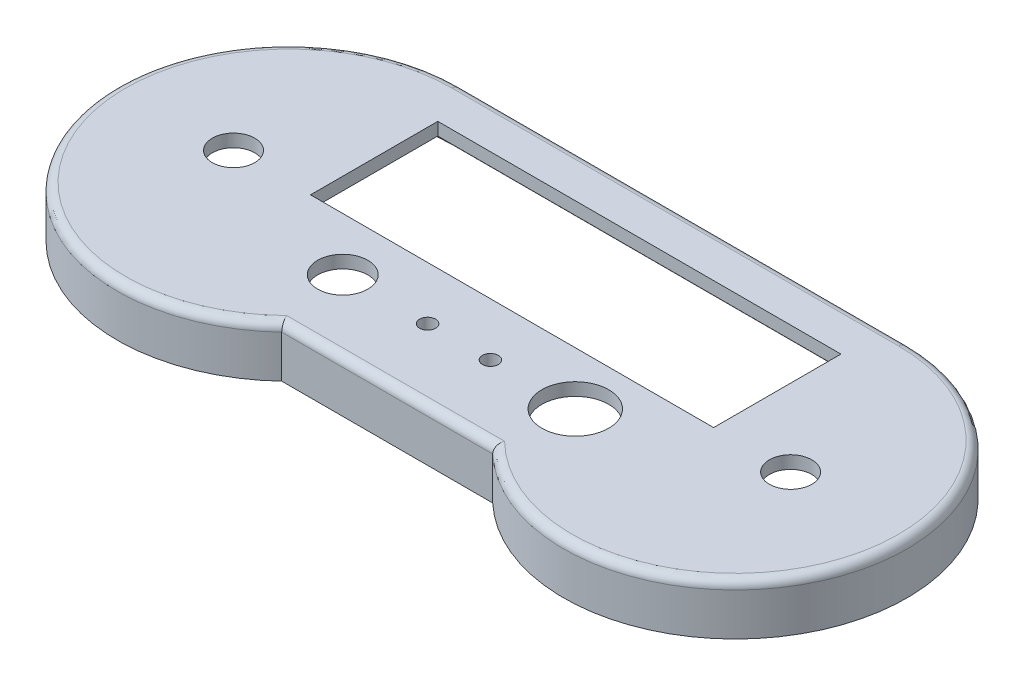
ISO-10303-21;
HEADER;
FILE_DESCRIPTION(('STEP AP214'),'2;1');
FILE_NAME('part.step','',(''),(''),'','','');
FILE_SCHEMA(('AUTOMOTIVE_DESIGN { 1 0 10303 214 1 1 1 1 }'));
ENDSEC;
DATA;
#1=APPLICATION_CONTEXT('core data for automotive mechanical design processes');
#2=APPLICATION_PROTOCOL_DEFINITION('international standard','automotive_design',2000,#1);
#3=PRODUCT_CONTEXT('',#1,'mechanical');
#4=PRODUCT('Part','Part','',(#3));
#5=PRODUCT_RELATED_PRODUCT_CATEGORY('part','',(#4));
#6=PRODUCT_DEFINITION_FORMATION('','',#4);
#7=PRODUCT_DEFINITION_CONTEXT('part definition',#1,'design');
#8=PRODUCT_DEFINITION('design','',#6,#7);
#9=PRODUCT_DEFINITION_SHAPE('','',#8);
#10=(LENGTH_UNIT() NAMED_UNIT(*) SI_UNIT(.MILLI.,.METRE.));
#11=(NAMED_UNIT(*) PLANE_ANGLE_UNIT() SI_UNIT($,.RADIAN.));
#12=(NAMED_UNIT(*) SI_UNIT($,.STERADIAN.) SOLID_ANGLE_UNIT());
#13=UNCERTAINTY_MEASURE_WITH_UNIT(LENGTH_MEASURE(1.E-05),#10,'distance_accuracy_value','');
#14=(GEOMETRIC_REPRESENTATION_CONTEXT(3) GLOBAL_UNCERTAINTY_ASSIGNED_CONTEXT((#13)) GLOBAL_UNIT_ASSIGNED_CONTEXT((#10,
#11,#12)) REPRESENTATION_CONTEXT('',''));
#15=CARTESIAN_POINT('',(0.,0.,0.));
#16=DIRECTION('',(0.,0.,1.));
#17=DIRECTION('',(1.,0.,0.));
#18=AXIS2_PLACEMENT_3D('',#15,#16,#17);
#19=CARTESIAN_POINT('',(66.8305917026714,15.24,0.));
#20=DIRECTION('',(0.,1.,0.));
#21=DIRECTION('',(0.,0.,1.));
#22=AXIS2_PLACEMENT_3D('',#19,#20,#21);
#23=PLANE('',#22);
#24=CARTESIAN_POINT('',(34.798,15.24,15.875));
#25=DIRECTION('',(0.,1.,0.));
#26=DIRECTION('',(0.,0.,1.));
#27=AXIS2_PLACEMENT_3D('',#24,#25,#26);
#28=CIRCLE('',#27,10.0000054);
#29=CARTESIAN_POINT('',(34.798,15.24,25.8750054));
#30=VERTEX_POINT('',#29);
#31=EDGE_CURVE('E815',#30,#30,#28,.T.);
#32=ORIENTED_EDGE('',*,*,#31,.F.);
#33=EDGE_LOOP('',(#32));
#34=FACE_BOUND('',#33,.T.);
#35=CARTESIAN_POINT('',(9.398,15.24,15.875));
#36=DIRECTION('',(0.,1.,0.));
#37=DIRECTION('',(0.,0.,1.));
#38=AXIS2_PLACEMENT_3D('',#35,#36,#37);
#39=CIRCLE('',#38,2.38125);
#40=CARTESIAN_POINT('',(9.398,15.24,18.25625));
#41=VERTEX_POINT('',#40);
#42=EDGE_CURVE('E806',#41,#41,#39,.T.);
#43=ORIENTED_EDGE('',*,*,#42,.F.);
#44=EDGE_LOOP('',(#43));
#45=FACE_BOUND('',#44,.T.);
#46=CARTESIAN_POINT('',(-9.398,15.24,15.875));
#47=DIRECTION('',(0.,1.,0.));
#48=DIRECTION('',(0.,0.,1.));
#49=AXIS2_PLACEMENT_3D('',#46,#47,#48);
#50=CIRCLE('',#49,2.38125000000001);
#51=CARTESIAN_POINT('',(-9.398,15.24,18.25625));
#52=VERTEX_POINT('',#51);
#53=EDGE_CURVE('E805',#52,#52,#50,.T.);
#54=ORIENTED_EDGE('',*,*,#53,.F.);
#55=EDGE_LOOP('',(#54));
#56=FACE_BOUND('',#55,.T.);
#57=CARTESIAN_POINT('',(-83.3648645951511,15.24,0.));
#58=DIRECTION('',(0.,1.,0.));
#59=DIRECTION('',(0.,0.,1.));
#60=AXIS2_PLACEMENT_3D('',#57,#58,#59);
#61=CIRCLE('',#60,6.35);
#62=CARTESIAN_POINT('',(-83.3648645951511,15.24,6.35));
#63=VERTEX_POINT('',#62);
#64=EDGE_CURVE('E867',#63,#63,#61,.T.);
#65=ORIENTED_EDGE('',*,*,#64,.F.);
#66=EDGE_LOOP('',(#65));
#67=FACE_BOUND('',#66,.T.);
#68=CARTESIAN_POINT('',(-66.8305917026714,15.24,0.));
#69=DIRECTION('',(0.,1.,0.));
#70=DIRECTION('',(0.,0.,1.));
#71=AXIS2_PLACEMENT_3D('',#68,#69,#70);
#72=CIRCLE('',#71,48.8354461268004);
#73=CARTESIAN_POINT('',(-66.8305917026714,15.24,-48.8354461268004));
#74=VERTEX_POINT('',#73);
#75=CARTESIAN_POINT('',(-32.5927544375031,15.24,34.8234302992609));
#76=VERTEX_POINT('',#75);
#77=EDGE_CURVE('E697',#74,#76,#72,.T.);
#78=ORIENTED_EDGE('',*,*,#77,.T.);
#79=DIRECTION('',(1.,0.,0.));
#80=VECTOR('',#79,1.);
#81=CARTESIAN_POINT('',(31.5685648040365,15.24,34.8234302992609));
#82=LINE('',#81,#80);
#83=CARTESIAN_POINT('',(32.5927544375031,15.24,34.8234302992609));
#84=VERTEX_POINT('',#83);
#85=EDGE_CURVE('E726',#76,#84,#82,.T.);
#86=ORIENTED_EDGE('',*,*,#85,.T.);
#87=CARTESIAN_POINT('',(66.8305917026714,15.24,0.));
#88=DIRECTION('',(0.,1.,0.));
#89=DIRECTION('',(0.,0.,1.));
#90=AXIS2_PLACEMENT_3D('',#87,#88,#89);
#91=CIRCLE('',#90,48.8354461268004);
#92=CARTESIAN_POINT('',(66.8305917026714,15.24,-48.8354461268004));
#93=VERTEX_POINT('',#92);
#94=EDGE_CURVE('E735',#84,#93,#91,.T.);
#95=ORIENTED_EDGE('',*,*,#94,.T.);
#96=DIRECTION('',(-1.,0.,0.));
#97=VECTOR('',#96,1.);
#98=CARTESIAN_POINT('',(-66.8305917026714,15.24,-48.8354461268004));
#99=LINE('',#98,#97);
#100=EDGE_CURVE('E732',#93,#74,#99,.T.);
#101=ORIENTED_EDGE('',*,*,#100,.T.);
#102=EDGE_LOOP('',(#78,#86,#95,#101));
#103=FACE_BOUND('',#102,.T.);
#104=CARTESIAN_POINT('',(-34.798,15.24,15.875));
#105=DIRECTION('',(0.,1.,0.));
#106=DIRECTION('',(0.,0.,1.));
#107=AXIS2_PLACEMENT_3D('',#104,#105,#106);
#108=CIRCLE('',#107,7.4999977);
#109=CARTESIAN_POINT('',(-34.798,15.24,23.3749977));
#110=VERTEX_POINT('',#109);
#111=EDGE_CURVE('E801',#110,#110,#108,.T.);
#112=ORIENTED_EDGE('',*,*,#111,.F.);
#113=EDGE_LOOP('',(#112));
#114=FACE_BOUND('',#113,.T.);
#115=CARTESIAN_POINT('',(83.3648645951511,15.24,0.));
#116=DIRECTION('',(0.,-1.,0.));
#117=DIRECTION('',(0.,0.,-1.));
#118=AXIS2_PLACEMENT_3D('',#115,#116,#117);
#119=CIRCLE('',#118,6.35);
#120=CARTESIAN_POINT('',(83.3648645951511,15.24,6.35));
#121=VERTEX_POINT('',#120);
#122=EDGE_CURVE('E874',#121,#121,#119,.T.);
#123=ORIENTED_EDGE('',*,*,#122,.T.);
#124=EDGE_LOOP('',(#123));
#125=FACE_BOUND('',#124,.T.);
#126=DIRECTION('',(1.,0.,0.));
#127=VECTOR('',#126,1.);
#128=CARTESIAN_POINT('',(-60.325,15.24,0.));
#129=LINE('',#128,#127);
#130=CARTESIAN_POINT('',(-60.325,15.24,0.));
#131=VERTEX_POINT('',#130);
#132=CARTESIAN_POINT('',(60.325,15.24,0.));
#133=VERTEX_POINT('',#132);
#134=EDGE_CURVE('E846',#131,#133,#129,.T.);
#135=ORIENTED_EDGE('',*,*,#134,.F.);
#136=DIRECTION('',(0.,0.,-1.));
#137=VECTOR('',#136,1.);
#138=CARTESIAN_POINT('',(-60.325,15.24,0.));
#139=LINE('',#138,#137);
#140=CARTESIAN_POINT('',(-60.325,15.24,-38.1));
#141=VERTEX_POINT('',#140);
#142=EDGE_CURVE('E834',#131,#141,#139,.T.);
#143=ORIENTED_EDGE('',*,*,#142,.T.);
#144=DIRECTION('',(1.,0.,0.));
#145=VECTOR('',#144,1.);
#146=CARTESIAN_POINT('',(-60.325,15.24,-38.1));
#147=LINE('',#146,#145);
#148=CARTESIAN_POINT('',(60.325,15.24,-38.1));
#149=VERTEX_POINT('',#148);
#150=EDGE_CURVE('E838',#141,#149,#147,.T.);
#151=ORIENTED_EDGE('',*,*,#150,.T.);
#152=DIRECTION('',(0.,0.,-1.));
#153=VECTOR('',#152,1.);
#154=CARTESIAN_POINT('',(60.325,15.24,0.));
#155=LINE('',#154,#153);
#156=EDGE_CURVE('E842',#133,#149,#155,.T.);
#157=ORIENTED_EDGE('',*,*,#156,.F.);
#158=EDGE_LOOP('',(#135,#143,#151,#157));
#159=FACE_BOUND('',#158,.T.);
#160=ADVANCED_FACE('F201',(#34,#45,#56,#67,#103,#114,#125,#159),#23,.T.);
#161=CARTESIAN_POINT('',(66.8305917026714,11.43,0.));
#162=DIRECTION('',(0.,1.,0.));
#163=DIRECTION('',(0.,0.,1.));
#164=AXIS2_PLACEMENT_3D('',#161,#162,#163);
#165=PLANE('',#164);
#166=DIRECTION('',(0.,0.,1.));
#167=VECTOR('',#166,1.);
#168=CARTESIAN_POINT('',(43.0709619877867,11.43,-47.5654461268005));
#169=LINE('',#168,#167);
#170=CARTESIAN_POINT('',(43.0709619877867,11.43,-49.5974461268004));
#171=VERTEX_POINT('',#170);
#172=CARTESIAN_POINT('',(43.0709619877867,11.43,-47.5654461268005));
#173=VERTEX_POINT('',#172);
#174=EDGE_CURVE('E477',#171,#173,#169,.T.);
#175=ORIENTED_EDGE('',*,*,#174,.T.);
#176=DIRECTION('',(-1.,0.,0.));
#177=VECTOR('',#176,1.);
#178=CARTESIAN_POINT('',(-66.8305917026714,11.43,-47.5654461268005));
#179=LINE('',#178,#177);
#180=CARTESIAN_POINT('',(66.8305917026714,11.43,-47.5654461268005));
#181=VERTEX_POINT('',#180);
#182=EDGE_CURVE('E788',#181,#173,#179,.T.);
#183=ORIENTED_EDGE('',*,*,#182,.F.);
#184=CARTESIAN_POINT('',(66.8305917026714,11.43,0.));
#185=DIRECTION('',(0.,1.,0.));
#186=DIRECTION('',(0.,0.,1.));
#187=AXIS2_PLACEMENT_3D('',#184,#185,#186);
#188=CIRCLE('',#187,47.5654461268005);
#189=CARTESIAN_POINT('',(33.1165148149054,11.43,33.5534302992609));
#190=VERTEX_POINT('',#189);
#191=EDGE_CURVE('E701',#190,#181,#188,.T.);
#192=ORIENTED_EDGE('',*,*,#191,.F.);
#193=DIRECTION('',(1.,0.,0.));
#194=VECTOR('',#193,1.);
#195=CARTESIAN_POINT('',(31.5685648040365,11.43,33.5534302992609));
#196=LINE('',#195,#194);
#197=CARTESIAN_POINT('',(-33.1165148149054,11.43,33.5534302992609));
#198=VERTEX_POINT('',#197);
#199=EDGE_CURVE('E782',#198,#190,#196,.T.);
#200=ORIENTED_EDGE('',*,*,#199,.F.);
#201=CARTESIAN_POINT('',(-66.8305917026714,11.43,0.));
#202=DIRECTION('',(0.,1.,0.));
#203=DIRECTION('',(0.,0.,1.));
#204=AXIS2_PLACEMENT_3D('',#201,#202,#203);
#205=CIRCLE('',#204,47.5654461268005);
#206=CARTESIAN_POINT('',(-66.8305917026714,11.43,-47.5654461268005));
#207=VERTEX_POINT('',#206);
#208=EDGE_CURVE('E785',#207,#198,#205,.T.);
#209=ORIENTED_EDGE('',*,*,#208,.F.);
#210=CARTESIAN_POINT('',(39.2609619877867,11.43,-47.5654461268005));
#211=VERTEX_POINT('',#210);
#212=EDGE_CURVE('E705',#211,#207,#179,.T.);
#213=ORIENTED_EDGE('',*,*,#212,.F.);
#214=DIRECTION('',(0.,0.,-1.));
#215=VECTOR('',#214,1.);
#216=CARTESIAN_POINT('',(39.2609619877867,11.43,-47.5654461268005));
#217=LINE('',#216,#215);
#218=CARTESIAN_POINT('',(39.2609619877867,11.43,-49.5974461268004));
#219=VERTEX_POINT('',#218);
#220=EDGE_CURVE('E478',#211,#219,#217,.T.);
#221=ORIENTED_EDGE('',*,*,#220,.T.);
#222=DIRECTION('',(1.,0.,0.));
#223=VECTOR('',#222,1.);
#224=CARTESIAN_POINT('',(41.1659619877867,11.43,-49.5974461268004));
#225=LINE('',#224,#223);
#226=EDGE_CURVE('E482',#219,#171,#225,.T.);
#227=ORIENTED_EDGE('',*,*,#226,.T.);
#228=EDGE_LOOP('',(#175,#183,#192,#200,#209,#213,#221,#227));
#229=FACE_BOUND('',#228,.T.);
#230=DIRECTION('',(-1.,0.,0.));
#231=VECTOR('',#230,1.);
#232=CARTESIAN_POINT('',(-60.325,11.43,-38.1));
#233=LINE('',#232,#231);
#234=CARTESIAN_POINT('',(60.325,11.43,-38.1));
#235=VERTEX_POINT('',#234);
#236=CARTESIAN_POINT('',(-60.325,11.43,-38.1));
#237=VERTEX_POINT('',#236);
#238=EDGE_CURVE('E826',#235,#237,#233,.T.);
#239=ORIENTED_EDGE('',*,*,#238,.T.);
#240=DIRECTION('',(0.,0.,1.));
#241=VECTOR('',#240,1.);
#242=CARTESIAN_POINT('',(-60.325,11.43,0.));
#243=LINE('',#242,#241);
#244=CARTESIAN_POINT('',(-60.325,11.43,0.));
#245=VERTEX_POINT('',#244);
#246=EDGE_CURVE('E830',#237,#245,#243,.T.);
#247=ORIENTED_EDGE('',*,*,#246,.T.);
#248=DIRECTION('',(-1.,0.,0.));
#249=VECTOR('',#248,1.);
#250=CARTESIAN_POINT('',(-60.325,11.43,0.));
#251=LINE('',#250,#249);
#252=CARTESIAN_POINT('',(60.325,11.43,0.));
#253=VERTEX_POINT('',#252);
#254=EDGE_CURVE('E863',#253,#245,#251,.T.);
#255=ORIENTED_EDGE('',*,*,#254,.F.);
#256=DIRECTION('',(0.,0.,1.));
#257=VECTOR('',#256,1.);
#258=CARTESIAN_POINT('',(60.325,11.43,0.));
#259=LINE('',#258,#257);
#260=EDGE_CURVE('E822',#235,#253,#259,.T.);
#261=ORIENTED_EDGE('',*,*,#260,.F.);
#262=EDGE_LOOP('',(#239,#247,#255,#261));
#263=FACE_BOUND('',#262,.T.);
#264=CARTESIAN_POINT('',(34.798,11.43,15.875));
#265=DIRECTION('',(0.,1.,0.));
#266=DIRECTION('',(0.,0.,1.));
#267=AXIS2_PLACEMENT_3D('',#264,#265,#266);
#268=CIRCLE('',#267,10.0000054);
#269=CARTESIAN_POINT('',(34.798,11.43,25.8750054));
#270=VERTEX_POINT('',#269);
#271=EDGE_CURVE('E825',#270,#270,#268,.F.);
#272=ORIENTED_EDGE('',*,*,#271,.F.);
#273=EDGE_LOOP('',(#272));
#274=FACE_BOUND('',#273,.T.);
#275=CARTESIAN_POINT('',(9.398,11.43,15.875));
#276=DIRECTION('',(0.,1.,0.));
#277=DIRECTION('',(0.,0.,1.));
#278=AXIS2_PLACEMENT_3D('',#275,#276,#277);
#279=CIRCLE('',#278,2.38125);
#280=CARTESIAN_POINT('',(9.398,11.43,18.25625));
#281=VERTEX_POINT('',#280);
#282=EDGE_CURVE('E811',#281,#281,#279,.F.);
#283=ORIENTED_EDGE('',*,*,#282,.F.);
#284=EDGE_LOOP('',(#283));
#285=FACE_BOUND('',#284,.T.);
#286=CARTESIAN_POINT('',(-9.398,11.43,15.875));
#287=DIRECTION('',(0.,1.,0.));
#288=DIRECTION('',(0.,0.,1.));
#289=AXIS2_PLACEMENT_3D('',#286,#287,#288);
#290=CIRCLE('',#289,2.38125000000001);
#291=CARTESIAN_POINT('',(-9.398,11.43,18.25625));
#292=VERTEX_POINT('',#291);
#293=EDGE_CURVE('E810',#292,#292,#290,.F.);
#294=ORIENTED_EDGE('',*,*,#293,.F.);
#295=EDGE_LOOP('',(#294));
#296=FACE_BOUND('',#295,.T.);
#297=CARTESIAN_POINT('',(-83.3648645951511,11.43,0.));
#298=DIRECTION('',(0.,1.,0.));
#299=DIRECTION('',(0.,0.,1.));
#300=AXIS2_PLACEMENT_3D('',#297,#298,#299);
#301=CIRCLE('',#300,6.35);
#302=CARTESIAN_POINT('',(-83.3648645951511,11.43,6.35));
#303=VERTEX_POINT('',#302);
#304=EDGE_CURVE('E883',#303,#303,#301,.F.);
#305=ORIENTED_EDGE('',*,*,#304,.F.);
#306=EDGE_LOOP('',(#305));
#307=FACE_BOUND('',#306,.T.);
#308=CARTESIAN_POINT('',(-34.798,11.43,15.875));
#309=DIRECTION('',(0.,1.,0.));
#310=DIRECTION('',(0.,0.,1.));
#311=AXIS2_PLACEMENT_3D('',#308,#309,#310);
#312=CIRCLE('',#311,7.4999977);
#313=CARTESIAN_POINT('',(-34.798,11.43,23.3749977));
#314=VERTEX_POINT('',#313);
#315=EDGE_CURVE('E671',#314,#314,#312,.F.);
#316=ORIENTED_EDGE('',*,*,#315,.F.);
#317=EDGE_LOOP('',(#316));
#318=FACE_BOUND('',#317,.T.);
#319=CARTESIAN_POINT('',(83.3648645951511,11.43,0.));
#320=DIRECTION('',(0.,1.,0.));
#321=DIRECTION('',(0.,0.,1.));
#322=AXIS2_PLACEMENT_3D('',#319,#320,#321);
#323=CIRCLE('',#322,6.35);
#324=CARTESIAN_POINT('',(83.3648645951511,11.43,6.35));
#325=VERTEX_POINT('',#324);
#326=EDGE_CURVE('E878',#325,#325,#323,.T.);
#327=ORIENTED_EDGE('',*,*,#326,.T.);
#328=EDGE_LOOP('',(#327));
#329=FACE_BOUND('',#328,.T.);
#330=ADVANCED_FACE('F628',(#229,#263,#274,#285,#296,#307,#318,#329),#165,.F.);
#331=CARTESIAN_POINT('',(66.8305917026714,15.24,0.));
#332=DIRECTION('',(0.,-1.,0.));
#333=DIRECTION('',(0.,0.,-1.));
#334=AXIS2_PLACEMENT_3D('',#331,#332,#333);
#335=CYLINDRICAL_SURFACE('',#334,51.3754461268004);
#336=DIRECTION('',(0.,-1.,0.));
#337=VECTOR('',#336,1.);
#338=CARTESIAN_POINT('',(66.8305917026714,15.24,-51.3754461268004));
#339=LINE('',#338,#337);
#340=CARTESIAN_POINT('',(66.8305917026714,12.7,-51.3754461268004));
#341=VERTEX_POINT('',#340);
#342=CARTESIAN_POINT('',(66.8305917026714,0.,-51.3754461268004));
#343=VERTEX_POINT('',#342);
#344=EDGE_CURVE('E738',#341,#343,#339,.T.);
#345=ORIENTED_EDGE('',*,*,#344,.F.);
#346=CARTESIAN_POINT('',(66.8305917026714,12.7,0.));
#347=DIRECTION('',(0.,1.,0.));
#348=DIRECTION('',(0.,0.,1.));
#349=AXIS2_PLACEMENT_3D('',#346,#347,#348);
#350=CIRCLE('',#349,51.3754461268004);
#351=CARTESIAN_POINT('',(31.5685648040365,12.7,37.3634302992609));
#352=VERTEX_POINT('',#351);
#353=EDGE_CURVE('E672',#341,#352,#350,.F.);
#354=ORIENTED_EDGE('',*,*,#353,.T.);
#355=DIRECTION('',(0.,-1.,0.));
#356=VECTOR('',#355,1.);
#357=CARTESIAN_POINT('',(31.5685648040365,15.24,37.3634302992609));
#358=LINE('',#357,#356);
#359=CARTESIAN_POINT('',(31.5685648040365,0.,37.3634302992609));
#360=VERTEX_POINT('',#359);
#361=EDGE_CURVE('E747',#352,#360,#358,.T.);
#362=ORIENTED_EDGE('',*,*,#361,.T.);
#363=CARTESIAN_POINT('',(66.8305917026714,0.,0.));
#364=DIRECTION('',(0.,1.,0.));
#365=DIRECTION('',(0.,0.,1.));
#366=AXIS2_PLACEMENT_3D('',#363,#364,#365);
#367=CIRCLE('',#366,51.3754461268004);
#368=EDGE_CURVE('E762',#360,#343,#367,.T.);
#369=ORIENTED_EDGE('',*,*,#368,.T.);
#370=EDGE_LOOP('',(#345,#354,#362,#369));
#371=FACE_BOUND('',#370,.T.);
#372=ADVANCED_FACE('F631',(#371),#335,.T.);
#373=CARTESIAN_POINT('',(-66.8305917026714,15.24,-51.3754461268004));
#374=DIRECTION('',(0.,0.,1.));
#375=DIRECTION('',(1.,0.,0.));
#376=AXIS2_PLACEMENT_3D('',#373,#374,#375);
#377=PLANE('',#376);
#378=DIRECTION('',(0.,-1.,0.));
#379=VECTOR('',#378,1.);
#380=CARTESIAN_POINT('',(-66.8305917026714,15.24,-51.3754461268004));
#381=LINE('',#380,#379);
#382=CARTESIAN_POINT('',(-66.8305917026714,12.7,-51.3754461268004));
#383=VERTEX_POINT('',#382);
#384=CARTESIAN_POINT('',(-66.8305917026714,0.,-51.3754461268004));
#385=VERTEX_POINT('',#384);
#386=EDGE_CURVE('E741',#383,#385,#381,.T.);
#387=ORIENTED_EDGE('',*,*,#386,.F.);
#388=DIRECTION('',(-1.,0.,0.));
#389=VECTOR('',#388,1.);
#390=CARTESIAN_POINT('',(66.8305917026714,12.7,-51.3754461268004));
#391=LINE('',#390,#389);
#392=EDGE_CURVE('E720',#383,#341,#391,.F.);
#393=ORIENTED_EDGE('',*,*,#392,.T.);
#394=ORIENTED_EDGE('',*,*,#344,.T.);
#395=DIRECTION('',(-1.,0.,0.));
#396=VECTOR('',#395,1.);
#397=CARTESIAN_POINT('',(-66.8305917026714,0.,-51.3754461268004));
#398=LINE('',#397,#396);
#399=EDGE_CURVE('E758',#343,#385,#398,.T.);
#400=ORIENTED_EDGE('',*,*,#399,.T.);
#401=EDGE_LOOP('',(#387,#393,#394,#400));
#402=FACE_BOUND('',#401,.T.);
#403=ADVANCED_FACE('F646',(#402),#377,.F.);
#404=CARTESIAN_POINT('',(-66.8305917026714,15.24,0.));
#405=DIRECTION('',(0.,-1.,0.));
#406=DIRECTION('',(0.,0.,-1.));
#407=AXIS2_PLACEMENT_3D('',#404,#405,#406);
#408=CYLINDRICAL_SURFACE('',#407,51.3754461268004);
#409=DIRECTION('',(0.,-1.,0.));
#410=VECTOR('',#409,1.);
#411=CARTESIAN_POINT('',(-31.5685648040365,15.24,37.3634302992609));
#412=LINE('',#411,#410);
#413=CARTESIAN_POINT('',(-31.5685648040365,12.7,37.3634302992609));
#414=VERTEX_POINT('',#413);
#415=CARTESIAN_POINT('',(-31.5685648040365,0.,37.3634302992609));
#416=VERTEX_POINT('',#415);
#417=EDGE_CURVE('E744',#414,#416,#412,.T.);
#418=ORIENTED_EDGE('',*,*,#417,.F.);
#419=CARTESIAN_POINT('',(-66.8305917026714,12.7,0.));
#420=DIRECTION('',(0.,1.,0.));
#421=DIRECTION('',(0.,0.,1.));
#422=AXIS2_PLACEMENT_3D('',#419,#420,#421);
#423=CIRCLE('',#422,51.3754461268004);
#424=EDGE_CURVE('E695',#414,#383,#423,.F.);
#425=ORIENTED_EDGE('',*,*,#424,.T.);
#426=ORIENTED_EDGE('',*,*,#386,.T.);
#427=CARTESIAN_POINT('',(-66.8305917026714,0.,0.));
#428=DIRECTION('',(0.,1.,0.));
#429=DIRECTION('',(0.,0.,1.));
#430=AXIS2_PLACEMENT_3D('',#427,#428,#429);
#431=CIRCLE('',#430,51.3754461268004);
#432=EDGE_CURVE('E754',#385,#416,#431,.T.);
#433=ORIENTED_EDGE('',*,*,#432,.T.);
#434=EDGE_LOOP('',(#418,#425,#426,#433));
#435=FACE_BOUND('',#434,.T.);
#436=ADVANCED_FACE('F642',(#435),#408,.T.);
#437=CARTESIAN_POINT('',(31.5685648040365,15.24,37.3634302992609));
#438=DIRECTION('',(0.,0.,-1.));
#439=DIRECTION('',(-1.,0.,0.));
#440=AXIS2_PLACEMENT_3D('',#437,#438,#439);
#441=PLANE('',#440);
#442=ORIENTED_EDGE('',*,*,#361,.F.);
#443=DIRECTION('',(1.,0.,0.));
#444=VECTOR('',#443,1.);
#445=CARTESIAN_POINT('',(-31.5685648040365,12.7,37.3634302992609));
#446=LINE('',#445,#444);
#447=EDGE_CURVE('E723',#352,#414,#446,.F.);
#448=ORIENTED_EDGE('',*,*,#447,.T.);
#449=ORIENTED_EDGE('',*,*,#417,.T.);
#450=DIRECTION('',(1.,0.,0.));
#451=VECTOR('',#450,1.);
#452=CARTESIAN_POINT('',(31.5685648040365,0.,37.3634302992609));
#453=LINE('',#452,#451);
#454=EDGE_CURVE('E750',#416,#360,#453,.T.);
#455=ORIENTED_EDGE('',*,*,#454,.T.);
#456=EDGE_LOOP('',(#442,#448,#449,#455));
#457=FACE_BOUND('',#456,.T.);
#458=ADVANCED_FACE('F638',(#457),#441,.F.);
#459=CARTESIAN_POINT('',(66.8305917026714,0.,0.));
#460=DIRECTION('',(0.,1.,0.));
#461=DIRECTION('',(0.,0.,1.));
#462=AXIS2_PLACEMENT_3D('',#459,#460,#461);
#463=PLANE('',#462);
#464=CARTESIAN_POINT('',(-66.8305917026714,0.,0.));
#465=DIRECTION('',(0.,1.,0.));
#466=DIRECTION('',(0.,0.,1.));
#467=AXIS2_PLACEMENT_3D('',#464,#465,#466);
#468=CIRCLE('',#467,49.4704461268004);
#469=CARTESIAN_POINT('',(-32.3338561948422,0.,35.4584302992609));
#470=VERTEX_POINT('',#469);
#471=CARTESIAN_POINT('',(-66.8305917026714,0.,-49.4704461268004));
#472=VERTEX_POINT('',#471);
#473=EDGE_CURVE('E521',#470,#472,#468,.F.);
#474=ORIENTED_EDGE('',*,*,#473,.F.);
#475=DIRECTION('',(-1.,0.,0.));
#476=VECTOR('',#475,1.);
#477=CARTESIAN_POINT('',(66.8305917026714,0.,35.4584302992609));
#478=LINE('',#477,#476);
#479=CARTESIAN_POINT('',(32.3338561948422,0.,35.4584302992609));
#480=VERTEX_POINT('',#479);
#481=EDGE_CURVE('E516',#480,#470,#478,.T.);
#482=ORIENTED_EDGE('',*,*,#481,.F.);
#483=CARTESIAN_POINT('',(66.8305917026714,0.,0.));
#484=DIRECTION('',(0.,1.,0.));
#485=DIRECTION('',(0.,0.,1.));
#486=AXIS2_PLACEMENT_3D('',#483,#484,#485);
#487=CIRCLE('',#486,49.4704461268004);
#488=CARTESIAN_POINT('',(66.8305917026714,0.,-49.4704461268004));
#489=VERTEX_POINT('',#488);
#490=EDGE_CURVE('E512',#489,#480,#487,.F.);
#491=ORIENTED_EDGE('',*,*,#490,.F.);
#492=DIRECTION('',(1.,0.,0.));
#493=VECTOR('',#492,1.);
#494=CARTESIAN_POINT('',(66.8305917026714,0.,-49.4704461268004));
#495=LINE('',#494,#493);
#496=EDGE_CURVE('E517',#472,#489,#495,.T.);
#497=ORIENTED_EDGE('',*,*,#496,.F.);
#498=EDGE_LOOP('',(#474,#482,#491,#497));
#499=FACE_BOUND('',#498,.T.);
#500=ORIENTED_EDGE('',*,*,#368,.F.);
#501=ORIENTED_EDGE('',*,*,#454,.F.);
#502=ORIENTED_EDGE('',*,*,#432,.F.);
#503=ORIENTED_EDGE('',*,*,#399,.F.);
#504=EDGE_LOOP('',(#500,#501,#502,#503));
#505=FACE_BOUND('',#504,.T.);
#506=ADVANCED_FACE('F615',(#499,#505),#463,.F.);
#507=CARTESIAN_POINT('',(66.8305917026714,15.24,0.));
#508=DIRECTION('',(0.,-1.,0.));
#509=DIRECTION('',(0.,0.,-1.));
#510=AXIS2_PLACEMENT_3D('',#507,#508,#509);
#511=CYLINDRICAL_SURFACE('',#510,47.5654461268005);
#512=CARTESIAN_POINT('',(66.8305917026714,2.54,0.));
#513=DIRECTION('',(0.,1.,0.));
#514=DIRECTION('',(0.,0.,1.));
#515=AXIS2_PLACEMENT_3D('',#512,#513,#514);
#516=CIRCLE('',#515,47.5654461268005);
#517=CARTESIAN_POINT('',(33.1165148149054,2.54,33.5534302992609));
#518=VERTEX_POINT('',#517);
#519=CARTESIAN_POINT('',(66.8305917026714,2.54,-47.5654461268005));
#520=VERTEX_POINT('',#519);
#521=EDGE_CURVE('E879',#518,#520,#516,.T.);
#522=ORIENTED_EDGE('',*,*,#521,.F.);
#523=DIRECTION('',(0.,-1.,0.));
#524=VECTOR('',#523,1.);
#525=CARTESIAN_POINT('',(33.1165148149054,11.43,33.5534302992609));
#526=LINE('',#525,#524);
#527=EDGE_CURVE('E778',#190,#518,#526,.T.);
#528=ORIENTED_EDGE('',*,*,#527,.F.);
#529=ORIENTED_EDGE('',*,*,#191,.T.);
#530=DIRECTION('',(0.,1.,0.));
#531=VECTOR('',#530,1.);
#532=CARTESIAN_POINT('',(66.8305917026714,15.24,-47.5654461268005));
#533=LINE('',#532,#531);
#534=EDGE_CURVE('E766',#181,#520,#533,.F.);
#535=ORIENTED_EDGE('',*,*,#534,.T.);
#536=EDGE_LOOP('',(#522,#528,#529,#535));
#537=FACE_BOUND('',#536,.T.);
#538=ADVANCED_FACE('F611',(#537),#511,.F.);
#539=CARTESIAN_POINT('',(-66.8305917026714,15.24,-47.5654461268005));
#540=DIRECTION('',(0.,0.,1.));
#541=DIRECTION('',(1.,0.,0.));
#542=AXIS2_PLACEMENT_3D('',#539,#540,#541);
#543=PLANE('',#542);
#544=DIRECTION('',(-0.0523359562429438,0.998629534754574,0.));
#545=VECTOR('',#544,1.);
#546=CARTESIAN_POINT('',(-49.7071382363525,16.1374021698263,-47.5654461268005));
#547=LINE('',#546,#545);
#548=CARTESIAN_POINT('',(-49.0790247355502,4.15228260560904,-47.5654461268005));
#549=VERTEX_POINT('',#548);
#550=CARTESIAN_POINT('',(-49.4118141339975,10.502282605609,-47.5654461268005));
#551=VERTEX_POINT('',#550);
#552=EDGE_CURVE('E471',#549,#551,#547,.T.);
#553=ORIENTED_EDGE('',*,*,#552,.F.);
#554=DIRECTION('',(1.,0.,0.));
#555=VECTOR('',#554,1.);
#556=CARTESIAN_POINT('',(-51.3168141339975,4.15228260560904,-47.5654461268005));
#557=LINE('',#556,#555);
#558=CARTESIAN_POINT('',(-53.5546035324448,4.15228260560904,-47.5654461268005));
#559=VERTEX_POINT('',#558);
#560=EDGE_CURVE('E432',#559,#549,#557,.T.);
#561=ORIENTED_EDGE('',*,*,#560,.F.);
#562=DIRECTION('',(-0.0523359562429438,-0.998629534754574,0.));
#563=VECTOR('',#562,1.);
#564=CARTESIAN_POINT('',(-53.011476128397,14.5157708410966,-47.5654461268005));
#565=LINE('',#564,#563);
#566=CARTESIAN_POINT('',(-53.2218141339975,10.502282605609,-47.5654461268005));
#567=VERTEX_POINT('',#566);
#568=EDGE_CURVE('E462',#567,#559,#565,.T.);
#569=ORIENTED_EDGE('',*,*,#568,.F.);
#570=DIRECTION('',(-1.,0.,0.));
#571=VECTOR('',#570,1.);
#572=CARTESIAN_POINT('',(-66.8305917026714,10.502282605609,-47.5654461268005));
#573=LINE('',#572,#571);
#574=EDGE_CURVE('E712',#551,#567,#573,.T.);
#575=ORIENTED_EDGE('',*,*,#574,.F.);
#576=EDGE_LOOP('',(#553,#561,#569,#575));
#577=FACE_BOUND('',#576,.T.);
#578=DIRECTION('',(0.,-1.,0.));
#579=VECTOR('',#578,1.);
#580=CARTESIAN_POINT('',(-66.8305917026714,15.24,-47.5654461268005));
#581=LINE('',#580,#579);
#582=CARTESIAN_POINT('',(-66.8305917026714,2.54,-47.5654461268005));
#583=VERTEX_POINT('',#582);
#584=EDGE_CURVE('E770',#207,#583,#581,.T.);
#585=ORIENTED_EDGE('',*,*,#584,.T.);
#586=DIRECTION('',(-1.,0.,0.));
#587=VECTOR('',#586,1.);
#588=CARTESIAN_POINT('',(-66.8305917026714,2.54,-47.5654461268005));
#589=LINE('',#588,#587);
#590=EDGE_CURVE('E892',#520,#583,#589,.T.);
#591=ORIENTED_EDGE('',*,*,#590,.F.);
#592=ORIENTED_EDGE('',*,*,#534,.F.);
#593=ORIENTED_EDGE('',*,*,#182,.T.);
#594=DIRECTION('',(-0.0523359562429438,0.998629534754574,0.));
#595=VECTOR('',#594,1.);
#596=CARTESIAN_POINT('',(42.570809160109,20.9734844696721,-47.5654461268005));
#597=LINE('',#596,#595);
#598=CARTESIAN_POINT('',(43.403751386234,5.08,-47.5654461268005));
#599=VERTEX_POINT('',#598);
#600=EDGE_CURVE('E509',#599,#173,#597,.T.);
#601=ORIENTED_EDGE('',*,*,#600,.F.);
#602=DIRECTION('',(1.,0.,0.));
#603=VECTOR('',#602,1.);
#604=CARTESIAN_POINT('',(41.1659619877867,5.08,-47.5654461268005));
#605=LINE('',#604,#603);
#606=CARTESIAN_POINT('',(38.9281725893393,5.08,-47.5654461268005));
#607=VERTEX_POINT('',#606);
#608=EDGE_CURVE('E474',#607,#599,#605,.T.);
#609=ORIENTED_EDGE('',*,*,#608,.F.);
#610=DIRECTION('',(-0.0523359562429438,-0.998629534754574,0.));
#611=VECTOR('',#610,1.);
#612=CARTESIAN_POINT('',(39.1694983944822,9.6847706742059,-47.5654461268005));
#613=LINE('',#612,#611);
#614=EDGE_CURVE('E500',#211,#607,#613,.T.);
#615=ORIENTED_EDGE('',*,*,#614,.F.);
#616=ORIENTED_EDGE('',*,*,#212,.T.);
#617=EDGE_LOOP('',(#585,#591,#592,#593,#601,#609,#615,#616));
#618=FACE_BOUND('',#617,.T.);
#619=ADVANCED_FACE('F614',(#577,#618),#543,.T.);
#620=CARTESIAN_POINT('',(-66.8305917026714,15.24,0.));
#621=DIRECTION('',(0.,-1.,0.));
#622=DIRECTION('',(0.,0.,-1.));
#623=AXIS2_PLACEMENT_3D('',#620,#621,#622);
#624=CYLINDRICAL_SURFACE('',#623,47.5654461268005);
#625=CARTESIAN_POINT('',(-66.8305917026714,2.54,0.));
#626=DIRECTION('',(0.,1.,0.));
#627=DIRECTION('',(0.,0.,1.));
#628=AXIS2_PLACEMENT_3D('',#625,#626,#627);
#629=CIRCLE('',#628,47.5654461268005);
#630=CARTESIAN_POINT('',(-33.1165148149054,2.54,33.5534302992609));
#631=VERTEX_POINT('',#630);
#632=EDGE_CURVE('E545',#583,#631,#629,.T.);
#633=ORIENTED_EDGE('',*,*,#632,.F.);
#634=ORIENTED_EDGE('',*,*,#584,.F.);
#635=ORIENTED_EDGE('',*,*,#208,.T.);
#636=DIRECTION('',(0.,-1.,0.));
#637=VECTOR('',#636,1.);
#638=CARTESIAN_POINT('',(-33.1165148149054,11.43,33.5534302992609));
#639=LINE('',#638,#637);
#640=EDGE_CURVE('E774',#198,#631,#639,.T.);
#641=ORIENTED_EDGE('',*,*,#640,.T.);
#642=EDGE_LOOP('',(#633,#634,#635,#641));
#643=FACE_BOUND('',#642,.T.);
#644=ADVANCED_FACE('F619',(#643),#624,.F.);
#645=CARTESIAN_POINT('',(31.5685648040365,15.24,33.5534302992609));
#646=DIRECTION('',(0.,0.,-1.));
#647=DIRECTION('',(-1.,0.,0.));
#648=AXIS2_PLACEMENT_3D('',#645,#646,#647);
#649=PLANE('',#648);
#650=DIRECTION('',(0.0523359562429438,0.998629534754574,0.));
#651=VECTOR('',#650,1.);
#652=CARTESIAN_POINT('',(-6.838187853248,17.2528126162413,33.5534302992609));
#653=LINE('',#652,#651);
#654=CARTESIAN_POINT('',(-7.44641389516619,5.64716837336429,33.5534302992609));
#655=VERTEX_POINT('',#654);
#656=CARTESIAN_POINT('',(-7.18018237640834,10.7271683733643,33.5534302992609));
#657=VERTEX_POINT('',#656);
#658=EDGE_CURVE('E13',#655,#657,#653,.T.);
#659=ORIENTED_EDGE('',*,*,#658,.F.);
#660=DIRECTION('',(-1.,0.,0.));
#661=VECTOR('',#660,1.);
#662=CARTESIAN_POINT('',(-5.27518237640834,5.64716837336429,33.5534302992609));
#663=LINE('',#662,#661);
#664=CARTESIAN_POINT('',(-3.10395085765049,5.64716837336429,33.5534302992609));
#665=VERTEX_POINT('',#664);
#666=EDGE_CURVE('E423',#665,#655,#663,.T.);
#667=ORIENTED_EDGE('',*,*,#666,.F.);
#668=DIRECTION('',(0.0523359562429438,-0.998629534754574,0.));
#669=VECTOR('',#668,1.);
#670=CARTESIAN_POINT('',(-3.51034299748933,13.4015923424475,33.5534302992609));
#671=LINE('',#670,#669);
#672=CARTESIAN_POINT('',(-3.37018237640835,10.7271683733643,33.5534302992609));
#673=VERTEX_POINT('',#672);
#674=EDGE_CURVE('E715',#673,#665,#671,.T.);
#675=ORIENTED_EDGE('',*,*,#674,.F.);
#676=DIRECTION('',(1.,0.,0.));
#677=VECTOR('',#676,1.);
#678=CARTESIAN_POINT('',(31.5685648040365,10.7271683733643,33.5534302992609));
#679=LINE('',#678,#677);
#680=EDGE_CURVE('E210',#657,#673,#679,.T.);
#681=ORIENTED_EDGE('',*,*,#680,.F.);
#682=EDGE_LOOP('',(#659,#667,#675,#681));
#683=FACE_BOUND('',#682,.T.);
#684=DIRECTION('',(1.,0.,0.));
#685=VECTOR('',#684,1.);
#686=CARTESIAN_POINT('',(31.5685648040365,2.54,33.5534302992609));
#687=LINE('',#686,#685);
#688=EDGE_CURVE('E709',#631,#518,#687,.T.);
#689=ORIENTED_EDGE('',*,*,#688,.F.);
#690=ORIENTED_EDGE('',*,*,#640,.F.);
#691=ORIENTED_EDGE('',*,*,#199,.T.);
#692=ORIENTED_EDGE('',*,*,#527,.T.);
#693=EDGE_LOOP('',(#689,#690,#691,#692));
#694=FACE_BOUND('',#693,.T.);
#695=ADVANCED_FACE('F623',(#683,#694),#649,.T.);
#696=CARTESIAN_POINT('',(66.8305917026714,12.7,-48.8354461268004));
#697=DIRECTION('',(1.,0.,0.));
#698=DIRECTION('',(0.,0.,-1.));
#699=AXIS2_PLACEMENT_3D('',#696,#697,#698);
#700=CYLINDRICAL_SURFACE('',#699,2.54);
#701=CARTESIAN_POINT('',(66.8305917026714,12.7,-48.8354461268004));
#702=DIRECTION('',(1.,0.,0.));
#703=DIRECTION('',(0.,0.,-1.));
#704=AXIS2_PLACEMENT_3D('',#701,#702,#703);
#705=CIRCLE('',#704,2.54);
#706=EDGE_CURVE('E680',#341,#93,#705,.T.);
#707=ORIENTED_EDGE('',*,*,#706,.F.);
#708=ORIENTED_EDGE('',*,*,#392,.F.);
#709=CARTESIAN_POINT('',(-66.8305917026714,12.7,-48.8354461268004));
#710=DIRECTION('',(-1.,0.,0.));
#711=DIRECTION('',(0.,0.,1.));
#712=AXIS2_PLACEMENT_3D('',#709,#710,#711);
#713=CIRCLE('',#712,2.54);
#714=EDGE_CURVE('E693',#74,#383,#713,.T.);
#715=ORIENTED_EDGE('',*,*,#714,.F.);
#716=ORIENTED_EDGE('',*,*,#100,.F.);
#717=EDGE_LOOP('',(#707,#708,#715,#716));
#718=FACE_BOUND('',#717,.T.);
#719=ADVANCED_FACE('F203',(#718),#700,.T.);
#720=CARTESIAN_POINT('',(-66.8305917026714,12.7,0.));
#721=DIRECTION('',(0.,1.,0.));
#722=DIRECTION('',(0.,0.,1.));
#723=AXIS2_PLACEMENT_3D('',#720,#721,#722);
#724=TOROIDAL_SURFACE('',#723,48.8354461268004,2.54);
#725=ORIENTED_EDGE('',*,*,#714,.T.);
#726=ORIENTED_EDGE('',*,*,#424,.F.);
#727=CARTESIAN_POINT('',(-31.5685648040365,12.7,37.3634302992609));
#728=CARTESIAN_POINT('',(-31.5685613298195,12.7677730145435,37.3634395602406));
#729=CARTESIAN_POINT('',(-31.5696426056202,12.8355412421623,37.3607179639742));
#730=CARTESIAN_POINT('',(-31.5739479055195,12.9705644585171,37.3498841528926));
#731=CARTESIAN_POINT('',(-31.5771715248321,13.0378195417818,37.3417729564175));
#732=CARTESIAN_POINT('',(-31.5857237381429,13.1711666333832,37.32025876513));
#733=CARTESIAN_POINT('',(-31.59104688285,13.237261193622,37.3068694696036));
#734=CARTESIAN_POINT('',(-31.6037418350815,13.3679774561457,37.274948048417));
#735=CARTESIAN_POINT('',(-31.6111136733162,13.4325991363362,37.2564158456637));
#736=CARTESIAN_POINT('',(-31.6362059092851,13.6235521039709,37.1933607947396));
#737=CARTESIAN_POINT('',(-31.6569127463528,13.7471208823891,37.1413550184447));
#738=CARTESIAN_POINT('',(-31.7055405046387,13.9834180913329,37.0193717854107));
#739=CARTESIAN_POINT('',(-31.7334637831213,14.0961429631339,36.9493884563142));
#740=CARTESIAN_POINT('',(-31.7965280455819,14.3113160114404,36.7915659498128));
#741=CARTESIAN_POINT('',(-31.8318531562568,14.4133764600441,36.70327200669));
#742=CARTESIAN_POINT('',(-31.9081261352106,14.6013065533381,36.5129676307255));
#743=CARTESIAN_POINT('',(-31.9490757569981,14.6871711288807,36.4109529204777));
#744=CARTESIAN_POINT('',(-32.0383922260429,14.846399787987,36.18888411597));
#745=CARTESIAN_POINT('',(-32.0870723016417,14.9185396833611,36.0680791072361));
#746=CARTESIAN_POINT('',(-32.188261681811,15.0415435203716,35.8175403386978));
#747=CARTESIAN_POINT('',(-32.2407722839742,15.0924002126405,35.6878035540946));
#748=CARTESIAN_POINT('',(-32.3421388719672,15.1675884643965,35.4379602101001));
#749=CARTESIAN_POINT('',(-32.3907279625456,15.1942849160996,35.3184444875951));
#750=CARTESIAN_POINT('',(-32.4889295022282,15.2301942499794,35.0774216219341));
#751=CARTESIAN_POINT('',(-32.5385396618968,15.2394426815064,34.9559190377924));
#752=CARTESIAN_POINT('',(-32.589714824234,15.2399918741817,34.8308577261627));
#753=CARTESIAN_POINT('',(-32.5912346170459,15.2400000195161,34.8271439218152));
#754=CARTESIAN_POINT('',(-32.5927544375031,15.24,34.8234302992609));
#755=B_SPLINE_CURVE_WITH_KNOTS('',3,(#727,#728,#729,#730,#731,#732,#733,#734,#735,#736,#737,
#738,#739,#740,#741,#742,#743,#744,#745,#746,#747,#748,#749,#750,#751,#752,#753,#754),
.UNSPECIFIED.,.F.,.F.,(4,2,2,2,2,2,2,2,2,2,2,2,2,4),(0.,0.203247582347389,0.406456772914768,
0.609141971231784,0.811830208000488,1.21675684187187,1.62181591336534,2.03849864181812,
2.45531157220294,2.90007195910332,3.34498371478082,3.73911707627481,4.13244654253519,
4.14448475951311),.UNSPECIFIED.);
#756=EDGE_CURVE('E670',#76,#414,#755,.F.);
#757=ORIENTED_EDGE('',*,*,#756,.F.);
#758=ORIENTED_EDGE('',*,*,#77,.F.);
#759=EDGE_LOOP('',(#725,#726,#757,#758));
#760=FACE_BOUND('',#759,.T.);
#761=ADVANCED_FACE('F658',(#760),#724,.T.);
#762=CARTESIAN_POINT('',(66.8305917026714,12.7,0.));
#763=DIRECTION('',(0.,1.,0.));
#764=DIRECTION('',(0.,0.,1.));
#765=AXIS2_PLACEMENT_3D('',#762,#763,#764);
#766=TOROIDAL_SURFACE('',#765,48.8354461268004,2.54);
#767=ORIENTED_EDGE('',*,*,#706,.T.);
#768=ORIENTED_EDGE('',*,*,#94,.F.);
#769=CARTESIAN_POINT('',(31.5685648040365,12.7,37.3634302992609));
#770=CARTESIAN_POINT('',(31.5685613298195,12.7677730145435,37.3634395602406));
#771=CARTESIAN_POINT('',(31.5696426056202,12.8355412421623,37.3607179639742));
#772=CARTESIAN_POINT('',(31.5739479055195,12.9705644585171,37.3498841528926));
#773=CARTESIAN_POINT('',(31.5771715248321,13.0378195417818,37.3417729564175));
#774=CARTESIAN_POINT('',(31.5857237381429,13.1711666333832,37.32025876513));
#775=CARTESIAN_POINT('',(31.59104688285,13.237261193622,37.3068694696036));
#776=CARTESIAN_POINT('',(31.6037418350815,13.3679774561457,37.274948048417));
#777=CARTESIAN_POINT('',(31.6111136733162,13.4325991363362,37.2564158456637));
#778=CARTESIAN_POINT('',(31.6362059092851,13.6235521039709,37.1933607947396));
#779=CARTESIAN_POINT('',(31.6569127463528,13.7471208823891,37.1413550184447));
#780=CARTESIAN_POINT('',(31.7055405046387,13.9834180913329,37.0193717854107));
#781=CARTESIAN_POINT('',(31.7334637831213,14.0961429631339,36.9493884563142));
#782=CARTESIAN_POINT('',(31.7965280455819,14.3113160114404,36.7915659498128));
#783=CARTESIAN_POINT('',(31.8318531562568,14.4133764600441,36.70327200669));
#784=CARTESIAN_POINT('',(31.9081261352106,14.6013065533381,36.5129676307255));
#785=CARTESIAN_POINT('',(31.9490757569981,14.6871711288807,36.4109529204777));
#786=CARTESIAN_POINT('',(32.0383922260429,14.846399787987,36.18888411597));
#787=CARTESIAN_POINT('',(32.0870723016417,14.9185396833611,36.0680791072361));
#788=CARTESIAN_POINT('',(32.188261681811,15.0415435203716,35.8175403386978));
#789=CARTESIAN_POINT('',(32.2407722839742,15.0924002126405,35.6878035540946));
#790=CARTESIAN_POINT('',(32.3421388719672,15.1675884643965,35.4379602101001));
#791=CARTESIAN_POINT('',(32.3907279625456,15.1942849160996,35.3184444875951));
#792=CARTESIAN_POINT('',(32.4889295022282,15.2301942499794,35.0774216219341));
#793=CARTESIAN_POINT('',(32.5385396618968,15.2394426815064,34.9559190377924));
#794=CARTESIAN_POINT('',(32.589714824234,15.2399918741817,34.8308577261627));
#795=CARTESIAN_POINT('',(32.5912346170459,15.2400000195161,34.8271439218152));
#796=CARTESIAN_POINT('',(32.5927544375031,15.24,34.8234302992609));
#797=B_SPLINE_CURVE_WITH_KNOTS('',3,(#769,#770,#771,#772,#773,#774,#775,#776,#777,#778,#779,
#780,#781,#782,#783,#784,#785,#786,#787,#788,#789,#790,#791,#792,#793,#794,#795,#796),
.UNSPECIFIED.,.F.,.F.,(4,2,2,2,2,2,2,2,2,2,2,2,2,4),(0.,0.203247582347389,0.406456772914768,
0.609141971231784,0.811830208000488,1.21675684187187,1.62181591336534,2.03849864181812,
2.45531157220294,2.90007195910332,3.34498371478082,3.73911707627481,4.13244654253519,
4.14448475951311),.UNSPECIFIED.);
#798=EDGE_CURVE('E662',#352,#84,#797,.T.);
#799=ORIENTED_EDGE('',*,*,#798,.F.);
#800=ORIENTED_EDGE('',*,*,#353,.F.);
#801=EDGE_LOOP('',(#767,#768,#799,#800));
#802=FACE_BOUND('',#801,.T.);
#803=ADVANCED_FACE('F654',(#802),#766,.T.);
#804=CARTESIAN_POINT('',(66.8305917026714,12.7,34.8234302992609));
#805=DIRECTION('',(-1.,0.,0.));
#806=DIRECTION('',(0.,0.,1.));
#807=AXIS2_PLACEMENT_3D('',#804,#805,#806);
#808=CYLINDRICAL_SURFACE('',#807,2.54);
#809=ORIENTED_EDGE('',*,*,#756,.T.);
#810=ORIENTED_EDGE('',*,*,#447,.F.);
#811=ORIENTED_EDGE('',*,*,#798,.T.);
#812=ORIENTED_EDGE('',*,*,#85,.F.);
#813=EDGE_LOOP('',(#809,#810,#811,#812));
#814=FACE_BOUND('',#813,.T.);
#815=ADVANCED_FACE('F609',(#814),#808,.T.);
#816=CARTESIAN_POINT('',(-34.798,-0.000999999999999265,15.875));
#817=DIRECTION('',(0.,1.,0.));
#818=DIRECTION('',(0.,0.,1.));
#819=AXIS2_PLACEMENT_3D('',#816,#817,#818);
#820=CYLINDRICAL_SURFACE('',#819,7.4999977);
#821=CARTESIAN_POINT('',(-34.798,15.24,23.3749977));
#822=CARTESIAN_POINT('',(-34.798,15.2003125,23.3749977));
#823=CARTESIAN_POINT('',(-34.798,15.160625,23.3749977));
#824=CARTESIAN_POINT('',(-34.798,15.08125,23.3749977));
#825=CARTESIAN_POINT('',(-34.798,15.0415625,23.3749977));
#826=CARTESIAN_POINT('',(-34.798,14.9621875,23.3749977));
#827=CARTESIAN_POINT('',(-34.798,14.9225,23.3749977));
#828=CARTESIAN_POINT('',(-34.798,14.843125,23.3749977));
#829=CARTESIAN_POINT('',(-34.798,14.8034375,23.3749977));
#830=CARTESIAN_POINT('',(-34.798,14.7240625,23.3749977));
#831=CARTESIAN_POINT('',(-34.798,14.684375,23.3749977));
#832=CARTESIAN_POINT('',(-34.798,14.605,23.3749977));
#833=CARTESIAN_POINT('',(-34.798,14.5653125,23.3749977));
#834=CARTESIAN_POINT('',(-34.798,14.4859375,23.3749977));
#835=CARTESIAN_POINT('',(-34.798,14.44625,23.3749977));
#836=CARTESIAN_POINT('',(-34.798,14.366875,23.3749977));
#837=CARTESIAN_POINT('',(-34.798,14.3271875,23.3749977));
#838=CARTESIAN_POINT('',(-34.798,14.2478125,23.3749977));
#839=CARTESIAN_POINT('',(-34.798,14.208125,23.3749977));
#840=CARTESIAN_POINT('',(-34.798,14.12875,23.3749977));
#841=CARTESIAN_POINT('',(-34.798,14.0890625,23.3749977));
#842=CARTESIAN_POINT('',(-34.798,14.0096875,23.3749977));
#843=CARTESIAN_POINT('',(-34.798,13.97,23.3749977));
#844=CARTESIAN_POINT('',(-34.798,13.890625,23.3749977));
#845=CARTESIAN_POINT('',(-34.798,13.8509375,23.3749977));
#846=CARTESIAN_POINT('',(-34.798,13.7715625,23.3749977));
#847=CARTESIAN_POINT('',(-34.798,13.731875,23.3749977));
#848=CARTESIAN_POINT('',(-34.798,13.6525,23.3749977));
#849=CARTESIAN_POINT('',(-34.798,13.6128125,23.3749977));
#850=CARTESIAN_POINT('',(-34.798,13.5334375,23.3749977));
#851=CARTESIAN_POINT('',(-34.798,13.49375,23.3749977));
#852=CARTESIAN_POINT('',(-34.798,13.414375,23.3749977));
#853=CARTESIAN_POINT('',(-34.798,13.3746875,23.3749977));
#854=CARTESIAN_POINT('',(-34.798,13.2953125,23.3749977));
#855=CARTESIAN_POINT('',(-34.798,13.255625,23.3749977));
#856=CARTESIAN_POINT('',(-34.798,13.17625,23.3749977));
#857=CARTESIAN_POINT('',(-34.798,13.1365625,23.3749977));
#858=CARTESIAN_POINT('',(-34.798,13.0571875,23.3749977));
#859=CARTESIAN_POINT('',(-34.798,13.0175,23.3749977));
#860=CARTESIAN_POINT('',(-34.798,12.938125,23.3749977));
#861=CARTESIAN_POINT('',(-34.798,12.8984375,23.3749977));
#862=CARTESIAN_POINT('',(-34.798,12.8190625,23.3749977));
#863=CARTESIAN_POINT('',(-34.798,12.779375,23.3749977));
#864=CARTESIAN_POINT('',(-34.798,12.7,23.3749977));
#865=CARTESIAN_POINT('',(-34.798,12.6603125,23.3749977));
#866=CARTESIAN_POINT('',(-34.798,12.5809375,23.3749977));
#867=CARTESIAN_POINT('',(-34.798,12.54125,23.3749977));
#868=CARTESIAN_POINT('',(-34.798,12.461875,23.3749977));
#869=CARTESIAN_POINT('',(-34.798,12.4221875,23.3749977));
#870=CARTESIAN_POINT('',(-34.798,12.3428125,23.3749977));
#871=CARTESIAN_POINT('',(-34.798,12.303125,23.3749977));
#872=CARTESIAN_POINT('',(-34.798,12.22375,23.3749977));
#873=CARTESIAN_POINT('',(-34.798,12.1840625,23.3749977));
#874=CARTESIAN_POINT('',(-34.798,12.1046875,23.3749977));
#875=CARTESIAN_POINT('',(-34.798,12.065,23.3749977));
#876=CARTESIAN_POINT('',(-34.798,11.985625,23.3749977));
#877=CARTESIAN_POINT('',(-34.798,11.9459375,23.3749977));
#878=CARTESIAN_POINT('',(-34.798,11.8665625,23.3749977));
#879=CARTESIAN_POINT('',(-34.798,11.826875,23.3749977));
#880=CARTESIAN_POINT('',(-34.798,11.7475,23.3749977));
#881=CARTESIAN_POINT('',(-34.798,11.7078125,23.3749977));
#882=CARTESIAN_POINT('',(-34.798,11.6284375,23.3749977));
#883=CARTESIAN_POINT('',(-34.798,11.58875,23.3749977));
#884=CARTESIAN_POINT('',(-34.798,11.509375,23.3749977));
#885=CARTESIAN_POINT('',(-34.798,11.4696875,23.3749977));
#886=CARTESIAN_POINT('',(-34.798,11.43,23.3749977));
#887=B_SPLINE_CURVE_WITH_KNOTS('',3,(#821,#822,#823,#824,#825,#826,#827,#828,#829,#830,#831,
#832,#833,#834,#835,#836,#837,#838,#839,#840,#841,#842,#843,#844,#845,#846,#847,#848,#849,#850,
#851,#852,#853,#854,#855,#856,#857,#858,#859,#860,#861,#862,#863,#864,#865,#866,#867,#868,#869,
#870,#871,#872,#873,#874,#875,#876,#877,#878,#879,#880,#881,#882,#883,#884,#885,#886),
.UNSPECIFIED.,.F.,.F.,(4,2,2,2,2,2,2,2,2,2,2,2,2,2,2,2,2,2,2,2,2,2,2,2,2,2,2,2,2,2,2,2,4),(0.,
0.119062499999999,0.238125,0.3571875,0.476249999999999,0.5953125,0.714375,0.833437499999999,
0.952499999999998,1.0715625,1.190625,1.3096875,1.42875,1.5478125,1.666875,1.7859375,1.905,
2.0240625,2.143125,2.2621875,2.38125,2.5003125,2.619375,2.7384375,2.8575,2.9765625,3.095625,
3.2146875,3.33375,3.4528125,3.571875,3.6909375,3.81),.UNSPECIFIED.);
#888=EDGE_CURVE('BSEAM579',#110,#314,#887,.T.);
#889=ORIENTED_EDGE('',*,*,#111,.T.);
#890=ORIENTED_EDGE('',*,*,#315,.T.);
#891=ORIENTED_EDGE('',*,*,#888,.T.);
#892=ORIENTED_EDGE('',*,*,#888,.F.);
#893=EDGE_LOOP('',(#889,#891,#890,#892));
#894=FACE_BOUND('',#893,.T.);
#895=ADVANCED_FACE('F579',(#894),#820,.F.);
#896=CARTESIAN_POINT('',(83.3648645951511,-0.000999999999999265,0.));
#897=DIRECTION('',(0.,1.,0.));
#898=DIRECTION('',(0.,0.,1.));
#899=AXIS2_PLACEMENT_3D('',#896,#897,#898);
#900=CYLINDRICAL_SURFACE('',#899,6.35);
#901=CARTESIAN_POINT('',(83.3648645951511,15.24,6.35));
#902=CARTESIAN_POINT('',(83.3648645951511,15.2003125,6.35));
#903=CARTESIAN_POINT('',(83.3648645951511,15.160625,6.35));
#904=CARTESIAN_POINT('',(83.3648645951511,15.08125,6.35));
#905=CARTESIAN_POINT('',(83.3648645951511,15.0415625,6.35));
#906=CARTESIAN_POINT('',(83.3648645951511,14.9621875,6.35));
#907=CARTESIAN_POINT('',(83.3648645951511,14.9225,6.35));
#908=CARTESIAN_POINT('',(83.3648645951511,14.843125,6.35));
#909=CARTESIAN_POINT('',(83.3648645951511,14.8034375,6.35));
#910=CARTESIAN_POINT('',(83.3648645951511,14.7240625,6.35));
#911=CARTESIAN_POINT('',(83.3648645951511,14.684375,6.35));
#912=CARTESIAN_POINT('',(83.3648645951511,14.605,6.35));
#913=CARTESIAN_POINT('',(83.3648645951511,14.5653125,6.35));
#914=CARTESIAN_POINT('',(83.3648645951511,14.4859375,6.35));
#915=CARTESIAN_POINT('',(83.3648645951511,14.44625,6.35));
#916=CARTESIAN_POINT('',(83.3648645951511,14.366875,6.35));
#917=CARTESIAN_POINT('',(83.3648645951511,14.3271875,6.35));
#918=CARTESIAN_POINT('',(83.3648645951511,14.2478125,6.35));
#919=CARTESIAN_POINT('',(83.3648645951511,14.208125,6.35));
#920=CARTESIAN_POINT('',(83.3648645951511,14.12875,6.35));
#921=CARTESIAN_POINT('',(83.3648645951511,14.0890625,6.35));
#922=CARTESIAN_POINT('',(83.3648645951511,14.0096875,6.35));
#923=CARTESIAN_POINT('',(83.3648645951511,13.97,6.35));
#924=CARTESIAN_POINT('',(83.3648645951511,13.890625,6.35));
#925=CARTESIAN_POINT('',(83.3648645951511,13.8509375,6.35));
#926=CARTESIAN_POINT('',(83.3648645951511,13.7715625,6.35));
#927=CARTESIAN_POINT('',(83.3648645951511,13.731875,6.35));
#928=CARTESIAN_POINT('',(83.3648645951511,13.6525,6.35));
#929=CARTESIAN_POINT('',(83.3648645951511,13.6128125,6.35));
#930=CARTESIAN_POINT('',(83.3648645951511,13.5334375,6.35));
#931=CARTESIAN_POINT('',(83.3648645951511,13.49375,6.35));
#932=CARTESIAN_POINT('',(83.3648645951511,13.414375,6.35));
#933=CARTESIAN_POINT('',(83.3648645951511,13.3746875,6.35));
#934=CARTESIAN_POINT('',(83.3648645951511,13.2953125,6.35));
#935=CARTESIAN_POINT('',(83.3648645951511,13.255625,6.35));
#936=CARTESIAN_POINT('',(83.3648645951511,13.17625,6.35));
#937=CARTESIAN_POINT('',(83.3648645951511,13.1365625,6.35));
#938=CARTESIAN_POINT('',(83.3648645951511,13.0571875,6.35));
#939=CARTESIAN_POINT('',(83.3648645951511,13.0175,6.35));
#940=CARTESIAN_POINT('',(83.3648645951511,12.938125,6.35));
#941=CARTESIAN_POINT('',(83.3648645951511,12.8984375,6.35));
#942=CARTESIAN_POINT('',(83.3648645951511,12.8190625,6.35));
#943=CARTESIAN_POINT('',(83.3648645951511,12.779375,6.35));
#944=CARTESIAN_POINT('',(83.3648645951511,12.7,6.35));
#945=CARTESIAN_POINT('',(83.3648645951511,12.6603125,6.35));
#946=CARTESIAN_POINT('',(83.3648645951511,12.5809375,6.35));
#947=CARTESIAN_POINT('',(83.3648645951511,12.54125,6.35));
#948=CARTESIAN_POINT('',(83.3648645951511,12.461875,6.35));
#949=CARTESIAN_POINT('',(83.3648645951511,12.4221875,6.35));
#950=CARTESIAN_POINT('',(83.3648645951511,12.3428125,6.35));
#951=CARTESIAN_POINT('',(83.3648645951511,12.303125,6.35));
#952=CARTESIAN_POINT('',(83.3648645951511,12.22375,6.35));
#953=CARTESIAN_POINT('',(83.3648645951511,12.1840625,6.35));
#954=CARTESIAN_POINT('',(83.3648645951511,12.1046875,6.35));
#955=CARTESIAN_POINT('',(83.3648645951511,12.065,6.35));
#956=CARTESIAN_POINT('',(83.3648645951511,11.985625,6.35));
#957=CARTESIAN_POINT('',(83.3648645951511,11.9459375,6.35));
#958=CARTESIAN_POINT('',(83.3648645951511,11.8665625,6.35));
#959=CARTESIAN_POINT('',(83.3648645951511,11.826875,6.35));
#960=CARTESIAN_POINT('',(83.3648645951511,11.7475,6.35));
#961=CARTESIAN_POINT('',(83.3648645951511,11.7078125,6.35));
#962=CARTESIAN_POINT('',(83.3648645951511,11.6284375,6.35));
#963=CARTESIAN_POINT('',(83.3648645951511,11.58875,6.35));
#964=CARTESIAN_POINT('',(83.3648645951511,11.509375,6.35));
#965=CARTESIAN_POINT('',(83.3648645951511,11.4696875,6.35));
#966=CARTESIAN_POINT('',(83.3648645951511,11.43,6.35));
#967=B_SPLINE_CURVE_WITH_KNOTS('',3,(#901,#902,#903,#904,#905,#906,#907,#908,#909,#910,#911,
#912,#913,#914,#915,#916,#917,#918,#919,#920,#921,#922,#923,#924,#925,#926,#927,#928,#929,#930,
#931,#932,#933,#934,#935,#936,#937,#938,#939,#940,#941,#942,#943,#944,#945,#946,#947,#948,#949,
#950,#951,#952,#953,#954,#955,#956,#957,#958,#959,#960,#961,#962,#963,#964,#965,#966),
.UNSPECIFIED.,.F.,.F.,(4,2,2,2,2,2,2,2,2,2,2,2,2,2,2,2,2,2,2,2,2,2,2,2,2,2,2,2,2,2,2,2,4),(0.,
0.119062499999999,0.238125,0.3571875,0.476250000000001,0.5953125,0.714375,0.833437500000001,
0.9525,1.0715625,1.190625,1.3096875,1.42875,1.5478125,1.666875,1.7859375,1.905,2.0240625,
2.143125,2.2621875,2.38125,2.5003125,2.619375,2.7384375,2.8575,2.9765625,3.095625,3.2146875,
3.33375,3.4528125,3.571875,3.6909375,3.81),.UNSPECIFIED.);
#968=EDGE_CURVE('BSEAM575',#121,#325,#967,.T.);
#969=ORIENTED_EDGE('',*,*,#122,.F.);
#970=ORIENTED_EDGE('',*,*,#326,.F.);
#971=ORIENTED_EDGE('',*,*,#968,.T.);
#972=ORIENTED_EDGE('',*,*,#968,.F.);
#973=EDGE_LOOP('',(#969,#971,#970,#972));
#974=FACE_BOUND('',#973,.T.);
#975=ADVANCED_FACE('F575',(#974),#900,.F.);
#976=CARTESIAN_POINT('',(-83.3648645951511,-0.000999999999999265,0.));
#977=DIRECTION('',(0.,1.,0.));
#978=DIRECTION('',(0.,0.,1.));
#979=AXIS2_PLACEMENT_3D('',#976,#977,#978);
#980=CYLINDRICAL_SURFACE('',#979,6.35);
#981=CARTESIAN_POINT('',(-83.3648645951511,15.24,6.35));
#982=CARTESIAN_POINT('',(-83.3648645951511,15.2003125,6.35));
#983=CARTESIAN_POINT('',(-83.3648645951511,15.160625,6.35));
#984=CARTESIAN_POINT('',(-83.3648645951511,15.08125,6.35));
#985=CARTESIAN_POINT('',(-83.3648645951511,15.0415625,6.35));
#986=CARTESIAN_POINT('',(-83.3648645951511,14.9621875,6.35));
#987=CARTESIAN_POINT('',(-83.3648645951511,14.9225,6.35));
#988=CARTESIAN_POINT('',(-83.3648645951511,14.843125,6.35));
#989=CARTESIAN_POINT('',(-83.3648645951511,14.8034375,6.35));
#990=CARTESIAN_POINT('',(-83.3648645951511,14.7240625,6.35));
#991=CARTESIAN_POINT('',(-83.3648645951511,14.684375,6.35));
#992=CARTESIAN_POINT('',(-83.3648645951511,14.605,6.35));
#993=CARTESIAN_POINT('',(-83.3648645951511,14.5653125,6.35));
#994=CARTESIAN_POINT('',(-83.3648645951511,14.4859375,6.35));
#995=CARTESIAN_POINT('',(-83.3648645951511,14.44625,6.35));
#996=CARTESIAN_POINT('',(-83.3648645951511,14.366875,6.35));
#997=CARTESIAN_POINT('',(-83.3648645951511,14.3271875,6.35));
#998=CARTESIAN_POINT('',(-83.3648645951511,14.2478125,6.35));
#999=CARTESIAN_POINT('',(-83.3648645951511,14.208125,6.35));
#1000=CARTESIAN_POINT('',(-83.3648645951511,14.12875,6.35));
#1001=CARTESIAN_POINT('',(-83.3648645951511,14.0890625,6.35));
#1002=CARTESIAN_POINT('',(-83.3648645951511,14.0096875,6.35));
#1003=CARTESIAN_POINT('',(-83.3648645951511,13.97,6.35));
#1004=CARTESIAN_POINT('',(-83.3648645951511,13.890625,6.35));
#1005=CARTESIAN_POINT('',(-83.3648645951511,13.8509375,6.35));
#1006=CARTESIAN_POINT('',(-83.3648645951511,13.7715625,6.35));
#1007=CARTESIAN_POINT('',(-83.3648645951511,13.731875,6.35));
#1008=CARTESIAN_POINT('',(-83.3648645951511,13.6525,6.35));
#1009=CARTESIAN_POINT('',(-83.3648645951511,13.6128125,6.35));
#1010=CARTESIAN_POINT('',(-83.3648645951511,13.5334375,6.35));
#1011=CARTESIAN_POINT('',(-83.3648645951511,13.49375,6.35));
#1012=CARTESIAN_POINT('',(-83.3648645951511,13.414375,6.35));
#1013=CARTESIAN_POINT('',(-83.3648645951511,13.3746875,6.35));
#1014=CARTESIAN_POINT('',(-83.3648645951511,13.2953125,6.35));
#1015=CARTESIAN_POINT('',(-83.3648645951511,13.255625,6.35));
#1016=CARTESIAN_POINT('',(-83.3648645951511,13.17625,6.35));
#1017=CARTESIAN_POINT('',(-83.3648645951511,13.1365625,6.35));
#1018=CARTESIAN_POINT('',(-83.3648645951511,13.0571875,6.35));
#1019=CARTESIAN_POINT('',(-83.3648645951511,13.0175,6.35));
#1020=CARTESIAN_POINT('',(-83.3648645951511,12.938125,6.35));
#1021=CARTESIAN_POINT('',(-83.3648645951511,12.8984375,6.35));
#1022=CARTESIAN_POINT('',(-83.3648645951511,12.8190625,6.35));
#1023=CARTESIAN_POINT('',(-83.3648645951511,12.779375,6.35));
#1024=CARTESIAN_POINT('',(-83.3648645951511,12.7,6.35));
#1025=CARTESIAN_POINT('',(-83.3648645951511,12.6603125,6.35));
#1026=CARTESIAN_POINT('',(-83.3648645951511,12.5809375,6.35));
#1027=CARTESIAN_POINT('',(-83.3648645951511,12.54125,6.35));
#1028=CARTESIAN_POINT('',(-83.3648645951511,12.461875,6.35));
#1029=CARTESIAN_POINT('',(-83.3648645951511,12.4221875,6.35));
#1030=CARTESIAN_POINT('',(-83.3648645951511,12.3428125,6.35));
#1031=CARTESIAN_POINT('',(-83.3648645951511,12.303125,6.35));
#1032=CARTESIAN_POINT('',(-83.3648645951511,12.22375,6.35));
#1033=CARTESIAN_POINT('',(-83.3648645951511,12.1840625,6.35));
#1034=CARTESIAN_POINT('',(-83.3648645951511,12.1046875,6.35));
#1035=CARTESIAN_POINT('',(-83.3648645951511,12.065,6.35));
#1036=CARTESIAN_POINT('',(-83.3648645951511,11.985625,6.35));
#1037=CARTESIAN_POINT('',(-83.3648645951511,11.9459375,6.35));
#1038=CARTESIAN_POINT('',(-83.3648645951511,11.8665625,6.35));
#1039=CARTESIAN_POINT('',(-83.3648645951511,11.826875,6.35));
#1040=CARTESIAN_POINT('',(-83.3648645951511,11.7475,6.35));
#1041=CARTESIAN_POINT('',(-83.3648645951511,11.7078125,6.35));
#1042=CARTESIAN_POINT('',(-83.3648645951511,11.6284375,6.35));
#1043=CARTESIAN_POINT('',(-83.3648645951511,11.58875,6.35));
#1044=CARTESIAN_POINT('',(-83.3648645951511,11.509375,6.35));
#1045=CARTESIAN_POINT('',(-83.3648645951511,11.4696875,6.35));
#1046=CARTESIAN_POINT('',(-83.3648645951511,11.43,6.35));
#1047=B_SPLINE_CURVE_WITH_KNOTS('',3,(#981,#982,#983,#984,#985,#986,#987,#988,#989,#990,#991,
#992,#993,#994,#995,#996,#997,#998,#999,#1000,#1001,#1002,#1003,#1004,#1005,#1006,#1007,#1008,
#1009,#1010,#1011,#1012,#1013,#1014,#1015,#1016,#1017,#1018,#1019,#1020,#1021,#1022,#1023,#1024,
#1025,#1026,#1027,#1028,#1029,#1030,#1031,#1032,#1033,#1034,#1035,#1036,#1037,#1038,#1039,#1040,
#1041,#1042,#1043,#1044,#1045,#1046),.UNSPECIFIED.,.F.,.F.,(4,2,2,2,2,2,2,2,2,2,2,2,2,2,2,2,2,2,
2,2,2,2,2,2,2,2,2,2,2,2,2,2,4),(0.,0.119062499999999,0.238125,0.3571875,0.476249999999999,
0.5953125,0.714375,0.833437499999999,0.952499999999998,1.0715625,1.190625,1.3096875,1.42875,
1.5478125,1.666875,1.7859375,1.905,2.0240625,2.143125,2.2621875,2.38125,2.5003125,2.619375,
2.7384375,2.8575,2.9765625,3.095625,3.2146875,3.33375,3.4528125,3.571875,3.6909375,3.81),.UNSPECIFIED.);
#1048=EDGE_CURVE('BSEAM571',#63,#303,#1047,.T.);
#1049=ORIENTED_EDGE('',*,*,#64,.T.);
#1050=ORIENTED_EDGE('',*,*,#304,.T.);
#1051=ORIENTED_EDGE('',*,*,#1048,.T.);
#1052=ORIENTED_EDGE('',*,*,#1048,.F.);
#1053=EDGE_LOOP('',(#1049,#1051,#1050,#1052));
#1054=FACE_BOUND('',#1053,.T.);
#1055=ADVANCED_FACE('F571',(#1054),#980,.F.);
#1056=CARTESIAN_POINT('',(-9.398,-0.000999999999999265,15.875));
#1057=DIRECTION('',(0.,1.,0.));
#1058=DIRECTION('',(0.,0.,1.));
#1059=AXIS2_PLACEMENT_3D('',#1056,#1057,#1058);
#1060=CYLINDRICAL_SURFACE('',#1059,2.38125000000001);
#1061=CARTESIAN_POINT('',(-9.398,15.24,18.25625));
#1062=CARTESIAN_POINT('',(-9.398,15.2003125,18.25625));
#1063=CARTESIAN_POINT('',(-9.398,15.160625,18.25625));
#1064=CARTESIAN_POINT('',(-9.398,15.08125,18.25625));
#1065=CARTESIAN_POINT('',(-9.398,15.0415625,18.25625));
#1066=CARTESIAN_POINT('',(-9.398,14.9621875,18.25625));
#1067=CARTESIAN_POINT('',(-9.398,14.9225,18.25625));
#1068=CARTESIAN_POINT('',(-9.398,14.843125,18.25625));
#1069=CARTESIAN_POINT('',(-9.398,14.8034375,18.25625));
#1070=CARTESIAN_POINT('',(-9.398,14.7240625,18.25625));
#1071=CARTESIAN_POINT('',(-9.398,14.684375,18.25625));
#1072=CARTESIAN_POINT('',(-9.398,14.605,18.25625));
#1073=CARTESIAN_POINT('',(-9.398,14.5653125,18.25625));
#1074=CARTESIAN_POINT('',(-9.398,14.4859375,18.25625));
#1075=CARTESIAN_POINT('',(-9.398,14.44625,18.25625));
#1076=CARTESIAN_POINT('',(-9.398,14.366875,18.25625));
#1077=CARTESIAN_POINT('',(-9.398,14.3271875,18.25625));
#1078=CARTESIAN_POINT('',(-9.398,14.2478125,18.25625));
#1079=CARTESIAN_POINT('',(-9.398,14.208125,18.25625));
#1080=CARTESIAN_POINT('',(-9.398,14.12875,18.25625));
#1081=CARTESIAN_POINT('',(-9.398,14.0890625,18.25625));
#1082=CARTESIAN_POINT('',(-9.398,14.0096875,18.25625));
#1083=CARTESIAN_POINT('',(-9.398,13.97,18.25625));
#1084=CARTESIAN_POINT('',(-9.398,13.890625,18.25625));
#1085=CARTESIAN_POINT('',(-9.398,13.8509375,18.25625));
#1086=CARTESIAN_POINT('',(-9.398,13.7715625,18.25625));
#1087=CARTESIAN_POINT('',(-9.398,13.731875,18.25625));
#1088=CARTESIAN_POINT('',(-9.398,13.6525,18.25625));
#1089=CARTESIAN_POINT('',(-9.398,13.6128125,18.25625));
#1090=CARTESIAN_POINT('',(-9.398,13.5334375,18.25625));
#1091=CARTESIAN_POINT('',(-9.398,13.49375,18.25625));
#1092=CARTESIAN_POINT('',(-9.398,13.414375,18.25625));
#1093=CARTESIAN_POINT('',(-9.398,13.3746875,18.25625));
#1094=CARTESIAN_POINT('',(-9.398,13.2953125,18.25625));
#1095=CARTESIAN_POINT('',(-9.398,13.255625,18.25625));
#1096=CARTESIAN_POINT('',(-9.398,13.17625,18.25625));
#1097=CARTESIAN_POINT('',(-9.398,13.1365625,18.25625));
#1098=CARTESIAN_POINT('',(-9.398,13.0571875,18.25625));
#1099=CARTESIAN_POINT('',(-9.398,13.0175,18.25625));
#1100=CARTESIAN_POINT('',(-9.398,12.938125,18.25625));
#1101=CARTESIAN_POINT('',(-9.398,12.8984375,18.25625));
#1102=CARTESIAN_POINT('',(-9.398,12.8190625,18.25625));
#1103=CARTESIAN_POINT('',(-9.398,12.779375,18.25625));
#1104=CARTESIAN_POINT('',(-9.398,12.7,18.25625));
#1105=CARTESIAN_POINT('',(-9.398,12.6603125,18.25625));
#1106=CARTESIAN_POINT('',(-9.398,12.5809375,18.25625));
#1107=CARTESIAN_POINT('',(-9.398,12.54125,18.25625));
#1108=CARTESIAN_POINT('',(-9.398,12.461875,18.25625));
#1109=CARTESIAN_POINT('',(-9.398,12.4221875,18.25625));
#1110=CARTESIAN_POINT('',(-9.398,12.3428125,18.25625));
#1111=CARTESIAN_POINT('',(-9.398,12.303125,18.25625));
#1112=CARTESIAN_POINT('',(-9.398,12.22375,18.25625));
#1113=CARTESIAN_POINT('',(-9.398,12.1840625,18.25625));
#1114=CARTESIAN_POINT('',(-9.398,12.1046875,18.25625));
#1115=CARTESIAN_POINT('',(-9.398,12.065,18.25625));
#1116=CARTESIAN_POINT('',(-9.398,11.985625,18.25625));
#1117=CARTESIAN_POINT('',(-9.398,11.9459375,18.25625));
#1118=CARTESIAN_POINT('',(-9.398,11.8665625,18.25625));
#1119=CARTESIAN_POINT('',(-9.398,11.826875,18.25625));
#1120=CARTESIAN_POINT('',(-9.398,11.7475,18.25625));
#1121=CARTESIAN_POINT('',(-9.398,11.7078125,18.25625));
#1122=CARTESIAN_POINT('',(-9.398,11.6284375,18.25625));
#1123=CARTESIAN_POINT('',(-9.398,11.58875,18.25625));
#1124=CARTESIAN_POINT('',(-9.398,11.509375,18.25625));
#1125=CARTESIAN_POINT('',(-9.398,11.4696875,18.25625));
#1126=CARTESIAN_POINT('',(-9.398,11.43,18.25625));
#1127=B_SPLINE_CURVE_WITH_KNOTS('',3,(#1061,#1062,#1063,#1064,#1065,#1066,#1067,#1068,#1069,
#1070,#1071,#1072,#1073,#1074,#1075,#1076,#1077,#1078,#1079,#1080,#1081,#1082,#1083,#1084,#1085,
#1086,#1087,#1088,#1089,#1090,#1091,#1092,#1093,#1094,#1095,#1096,#1097,#1098,#1099,#1100,#1101,
#1102,#1103,#1104,#1105,#1106,#1107,#1108,#1109,#1110,#1111,#1112,#1113,#1114,#1115,#1116,#1117,
#1118,#1119,#1120,#1121,#1122,#1123,#1124,#1125,#1126),.UNSPECIFIED.,.F.,.F.,(4,2,2,2,2,2,2,2,2,
2,2,2,2,2,2,2,2,2,2,2,2,2,2,2,2,2,2,2,2,2,2,2,4),(0.,0.119062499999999,0.238125,0.3571875,
0.476249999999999,0.5953125,0.714375,0.833437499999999,0.952499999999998,1.0715625,1.190625,
1.3096875,1.42875,1.5478125,1.666875,1.7859375,1.905,2.0240625,2.143125,2.2621875,2.38125,
2.5003125,2.619375,2.7384375,2.8575,2.9765625,3.095625,3.2146875,3.33375,3.4528125,3.571875,
3.6909375,3.81),.UNSPECIFIED.);
#1128=EDGE_CURVE('BSEAM574',#52,#292,#1127,.T.);
#1129=ORIENTED_EDGE('',*,*,#53,.T.);
#1130=ORIENTED_EDGE('',*,*,#293,.T.);
#1131=ORIENTED_EDGE('',*,*,#1128,.T.);
#1132=ORIENTED_EDGE('',*,*,#1128,.F.);
#1133=EDGE_LOOP('',(#1129,#1131,#1130,#1132));
#1134=FACE_BOUND('',#1133,.T.);
#1135=ADVANCED_FACE('F574',(#1134),#1060,.F.);
#1136=CARTESIAN_POINT('',(9.398,-0.000999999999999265,15.875));
#1137=DIRECTION('',(0.,1.,0.));
#1138=DIRECTION('',(0.,0.,1.));
#1139=AXIS2_PLACEMENT_3D('',#1136,#1137,#1138);
#1140=CYLINDRICAL_SURFACE('',#1139,2.38125);
#1141=CARTESIAN_POINT('',(9.398,15.24,18.25625));
#1142=CARTESIAN_POINT('',(9.398,15.2003125,18.25625));
#1143=CARTESIAN_POINT('',(9.398,15.160625,18.25625));
#1144=CARTESIAN_POINT('',(9.398,15.08125,18.25625));
#1145=CARTESIAN_POINT('',(9.398,15.0415625,18.25625));
#1146=CARTESIAN_POINT('',(9.398,14.9621875,18.25625));
#1147=CARTESIAN_POINT('',(9.398,14.9225,18.25625));
#1148=CARTESIAN_POINT('',(9.398,14.843125,18.25625));
#1149=CARTESIAN_POINT('',(9.398,14.8034375,18.25625));
#1150=CARTESIAN_POINT('',(9.398,14.7240625,18.25625));
#1151=CARTESIAN_POINT('',(9.398,14.684375,18.25625));
#1152=CARTESIAN_POINT('',(9.398,14.605,18.25625));
#1153=CARTESIAN_POINT('',(9.398,14.5653125,18.25625));
#1154=CARTESIAN_POINT('',(9.398,14.4859375,18.25625));
#1155=CARTESIAN_POINT('',(9.398,14.44625,18.25625));
#1156=CARTESIAN_POINT('',(9.398,14.366875,18.25625));
#1157=CARTESIAN_POINT('',(9.398,14.3271875,18.25625));
#1158=CARTESIAN_POINT('',(9.398,14.2478125,18.25625));
#1159=CARTESIAN_POINT('',(9.398,14.208125,18.25625));
#1160=CARTESIAN_POINT('',(9.398,14.12875,18.25625));
#1161=CARTESIAN_POINT('',(9.398,14.0890625,18.25625));
#1162=CARTESIAN_POINT('',(9.398,14.0096875,18.25625));
#1163=CARTESIAN_POINT('',(9.398,13.97,18.25625));
#1164=CARTESIAN_POINT('',(9.398,13.890625,18.25625));
#1165=CARTESIAN_POINT('',(9.398,13.8509375,18.25625));
#1166=CARTESIAN_POINT('',(9.398,13.7715625,18.25625));
#1167=CARTESIAN_POINT('',(9.398,13.731875,18.25625));
#1168=CARTESIAN_POINT('',(9.398,13.6525,18.25625));
#1169=CARTESIAN_POINT('',(9.398,13.6128125,18.25625));
#1170=CARTESIAN_POINT('',(9.398,13.5334375,18.25625));
#1171=CARTESIAN_POINT('',(9.398,13.49375,18.25625));
#1172=CARTESIAN_POINT('',(9.398,13.414375,18.25625));
#1173=CARTESIAN_POINT('',(9.398,13.3746875,18.25625));
#1174=CARTESIAN_POINT('',(9.398,13.2953125,18.25625));
#1175=CARTESIAN_POINT('',(9.398,13.255625,18.25625));
#1176=CARTESIAN_POINT('',(9.398,13.17625,18.25625));
#1177=CARTESIAN_POINT('',(9.398,13.1365625,18.25625));
#1178=CARTESIAN_POINT('',(9.398,13.0571875,18.25625));
#1179=CARTESIAN_POINT('',(9.398,13.0175,18.25625));
#1180=CARTESIAN_POINT('',(9.398,12.938125,18.25625));
#1181=CARTESIAN_POINT('',(9.398,12.8984375,18.25625));
#1182=CARTESIAN_POINT('',(9.398,12.8190625,18.25625));
#1183=CARTESIAN_POINT('',(9.398,12.779375,18.25625));
#1184=CARTESIAN_POINT('',(9.398,12.7,18.25625));
#1185=CARTESIAN_POINT('',(9.398,12.6603125,18.25625));
#1186=CARTESIAN_POINT('',(9.398,12.5809375,18.25625));
#1187=CARTESIAN_POINT('',(9.398,12.54125,18.25625));
#1188=CARTESIAN_POINT('',(9.398,12.461875,18.25625));
#1189=CARTESIAN_POINT('',(9.398,12.4221875,18.25625));
#1190=CARTESIAN_POINT('',(9.398,12.3428125,18.25625));
#1191=CARTESIAN_POINT('',(9.398,12.303125,18.25625));
#1192=CARTESIAN_POINT('',(9.398,12.22375,18.25625));
#1193=CARTESIAN_POINT('',(9.398,12.1840625,18.25625));
#1194=CARTESIAN_POINT('',(9.398,12.1046875,18.25625));
#1195=CARTESIAN_POINT('',(9.398,12.065,18.25625));
#1196=CARTESIAN_POINT('',(9.398,11.985625,18.25625));
#1197=CARTESIAN_POINT('',(9.398,11.9459375,18.25625));
#1198=CARTESIAN_POINT('',(9.398,11.8665625,18.25625));
#1199=CARTESIAN_POINT('',(9.398,11.826875,18.25625));
#1200=CARTESIAN_POINT('',(9.398,11.7475,18.25625));
#1201=CARTESIAN_POINT('',(9.398,11.7078125,18.25625));
#1202=CARTESIAN_POINT('',(9.398,11.6284375,18.25625));
#1203=CARTESIAN_POINT('',(9.398,11.58875,18.25625));
#1204=CARTESIAN_POINT('',(9.398,11.509375,18.25625));
#1205=CARTESIAN_POINT('',(9.398,11.4696875,18.25625));
#1206=CARTESIAN_POINT('',(9.398,11.43,18.25625));
#1207=B_SPLINE_CURVE_WITH_KNOTS('',3,(#1141,#1142,#1143,#1144,#1145,#1146,#1147,#1148,#1149,
#1150,#1151,#1152,#1153,#1154,#1155,#1156,#1157,#1158,#1159,#1160,#1161,#1162,#1163,#1164,#1165,
#1166,#1167,#1168,#1169,#1170,#1171,#1172,#1173,#1174,#1175,#1176,#1177,#1178,#1179,#1180,#1181,
#1182,#1183,#1184,#1185,#1186,#1187,#1188,#1189,#1190,#1191,#1192,#1193,#1194,#1195,#1196,#1197,
#1198,#1199,#1200,#1201,#1202,#1203,#1204,#1205,#1206),.UNSPECIFIED.,.F.,.F.,(4,2,2,2,2,2,2,2,2,
2,2,2,2,2,2,2,2,2,2,2,2,2,2,2,2,2,2,2,2,2,2,2,4),(0.,0.119062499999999,0.238125,0.3571875,
0.476249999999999,0.5953125,0.714375,0.833437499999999,0.952499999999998,1.0715625,1.190625,
1.3096875,1.42875,1.5478125,1.666875,1.7859375,1.905,2.0240625,2.143125,2.2621875,2.38125,
2.5003125,2.619375,2.7384375,2.8575,2.9765625,3.095625,3.2146875,3.33375,3.4528125,3.571875,
3.6909375,3.81),.UNSPECIFIED.);
#1208=EDGE_CURVE('BSEAM585',#41,#281,#1207,.T.);
#1209=ORIENTED_EDGE('',*,*,#42,.T.);
#1210=ORIENTED_EDGE('',*,*,#282,.T.);
#1211=ORIENTED_EDGE('',*,*,#1208,.T.);
#1212=ORIENTED_EDGE('',*,*,#1208,.F.);
#1213=EDGE_LOOP('',(#1209,#1211,#1210,#1212));
#1214=FACE_BOUND('',#1213,.T.);
#1215=ADVANCED_FACE('F585',(#1214),#1140,.F.);
#1216=CARTESIAN_POINT('',(34.798,-0.000999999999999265,15.875));
#1217=DIRECTION('',(0.,1.,0.));
#1218=DIRECTION('',(0.,0.,1.));
#1219=AXIS2_PLACEMENT_3D('',#1216,#1217,#1218);
#1220=CYLINDRICAL_SURFACE('',#1219,10.0000054);
#1221=CARTESIAN_POINT('',(34.798,15.24,25.8750054));
#1222=CARTESIAN_POINT('',(34.798,15.2003125,25.8750054));
#1223=CARTESIAN_POINT('',(34.798,15.160625,25.8750054));
#1224=CARTESIAN_POINT('',(34.798,15.08125,25.8750054));
#1225=CARTESIAN_POINT('',(34.798,15.0415625,25.8750054));
#1226=CARTESIAN_POINT('',(34.798,14.9621875,25.8750054));
#1227=CARTESIAN_POINT('',(34.798,14.9225,25.8750054));
#1228=CARTESIAN_POINT('',(34.798,14.843125,25.8750054));
#1229=CARTESIAN_POINT('',(34.798,14.8034375,25.8750054));
#1230=CARTESIAN_POINT('',(34.798,14.7240625,25.8750054));
#1231=CARTESIAN_POINT('',(34.798,14.684375,25.8750054));
#1232=CARTESIAN_POINT('',(34.798,14.605,25.8750054));
#1233=CARTESIAN_POINT('',(34.798,14.5653125,25.8750054));
#1234=CARTESIAN_POINT('',(34.798,14.4859375,25.8750054));
#1235=CARTESIAN_POINT('',(34.798,14.44625,25.8750054));
#1236=CARTESIAN_POINT('',(34.798,14.366875,25.8750054));
#1237=CARTESIAN_POINT('',(34.798,14.3271875,25.8750054));
#1238=CARTESIAN_POINT('',(34.798,14.2478125,25.8750054));
#1239=CARTESIAN_POINT('',(34.798,14.208125,25.8750054));
#1240=CARTESIAN_POINT('',(34.798,14.12875,25.8750054));
#1241=CARTESIAN_POINT('',(34.798,14.0890625,25.8750054));
#1242=CARTESIAN_POINT('',(34.798,14.0096875,25.8750054));
#1243=CARTESIAN_POINT('',(34.798,13.97,25.8750054));
#1244=CARTESIAN_POINT('',(34.798,13.890625,25.8750054));
#1245=CARTESIAN_POINT('',(34.798,13.8509375,25.8750054));
#1246=CARTESIAN_POINT('',(34.798,13.7715625,25.8750054));
#1247=CARTESIAN_POINT('',(34.798,13.731875,25.8750054));
#1248=CARTESIAN_POINT('',(34.798,13.6525,25.8750054));
#1249=CARTESIAN_POINT('',(34.798,13.6128125,25.8750054));
#1250=CARTESIAN_POINT('',(34.798,13.5334375,25.8750054));
#1251=CARTESIAN_POINT('',(34.798,13.49375,25.8750054));
#1252=CARTESIAN_POINT('',(34.798,13.414375,25.8750054));
#1253=CARTESIAN_POINT('',(34.798,13.3746875,25.8750054));
#1254=CARTESIAN_POINT('',(34.798,13.2953125,25.8750054));
#1255=CARTESIAN_POINT('',(34.798,13.255625,25.8750054));
#1256=CARTESIAN_POINT('',(34.798,13.17625,25.8750054));
#1257=CARTESIAN_POINT('',(34.798,13.1365625,25.8750054));
#1258=CARTESIAN_POINT('',(34.798,13.0571875,25.8750054));
#1259=CARTESIAN_POINT('',(34.798,13.0175,25.8750054));
#1260=CARTESIAN_POINT('',(34.798,12.938125,25.8750054));
#1261=CARTESIAN_POINT('',(34.798,12.8984375,25.8750054));
#1262=CARTESIAN_POINT('',(34.798,12.8190625,25.8750054));
#1263=CARTESIAN_POINT('',(34.798,12.779375,25.8750054));
#1264=CARTESIAN_POINT('',(34.798,12.7,25.8750054));
#1265=CARTESIAN_POINT('',(34.798,12.6603125,25.8750054));
#1266=CARTESIAN_POINT('',(34.798,12.5809375,25.8750054));
#1267=CARTESIAN_POINT('',(34.798,12.54125,25.8750054));
#1268=CARTESIAN_POINT('',(34.798,12.461875,25.8750054));
#1269=CARTESIAN_POINT('',(34.798,12.4221875,25.8750054));
#1270=CARTESIAN_POINT('',(34.798,12.3428125,25.8750054));
#1271=CARTESIAN_POINT('',(34.798,12.303125,25.8750054));
#1272=CARTESIAN_POINT('',(34.798,12.22375,25.8750054));
#1273=CARTESIAN_POINT('',(34.798,12.1840625,25.8750054));
#1274=CARTESIAN_POINT('',(34.798,12.1046875,25.8750054));
#1275=CARTESIAN_POINT('',(34.798,12.065,25.8750054));
#1276=CARTESIAN_POINT('',(34.798,11.985625,25.8750054));
#1277=CARTESIAN_POINT('',(34.798,11.9459375,25.8750054));
#1278=CARTESIAN_POINT('',(34.798,11.8665625,25.8750054));
#1279=CARTESIAN_POINT('',(34.798,11.826875,25.8750054));
#1280=CARTESIAN_POINT('',(34.798,11.7475,25.8750054));
#1281=CARTESIAN_POINT('',(34.798,11.7078125,25.8750054));
#1282=CARTESIAN_POINT('',(34.798,11.6284375,25.8750054));
#1283=CARTESIAN_POINT('',(34.798,11.58875,25.8750054));
#1284=CARTESIAN_POINT('',(34.798,11.509375,25.8750054));
#1285=CARTESIAN_POINT('',(34.798,11.4696875,25.8750054));
#1286=CARTESIAN_POINT('',(34.798,11.43,25.8750054));
#1287=B_SPLINE_CURVE_WITH_KNOTS('',3,(#1221,#1222,#1223,#1224,#1225,#1226,#1227,#1228,#1229,
#1230,#1231,#1232,#1233,#1234,#1235,#1236,#1237,#1238,#1239,#1240,#1241,#1242,#1243,#1244,#1245,
#1246,#1247,#1248,#1249,#1250,#1251,#1252,#1253,#1254,#1255,#1256,#1257,#1258,#1259,#1260,#1261,
#1262,#1263,#1264,#1265,#1266,#1267,#1268,#1269,#1270,#1271,#1272,#1273,#1274,#1275,#1276,#1277,
#1278,#1279,#1280,#1281,#1282,#1283,#1284,#1285,#1286),.UNSPECIFIED.,.F.,.F.,(4,2,2,2,2,2,2,2,2,
2,2,2,2,2,2,2,2,2,2,2,2,2,2,2,2,2,2,2,2,2,2,2,4),(0.,0.119062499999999,0.238125,0.3571875,
0.476249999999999,0.5953125,0.714375,0.833437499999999,0.952499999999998,1.0715625,1.190625,
1.3096875,1.42875,1.5478125,1.666875,1.7859375,1.905,2.0240625,2.143125,2.2621875,2.38125,
2.5003125,2.619375,2.7384375,2.8575,2.9765625,3.095625,3.2146875,3.33375,3.4528125,3.571875,
3.6909375,3.81),.UNSPECIFIED.);
#1288=EDGE_CURVE('BSEAM581',#30,#270,#1287,.T.);
#1289=ORIENTED_EDGE('',*,*,#31,.T.);
#1290=ORIENTED_EDGE('',*,*,#271,.T.);
#1291=ORIENTED_EDGE('',*,*,#1288,.T.);
#1292=ORIENTED_EDGE('',*,*,#1288,.F.);
#1293=EDGE_LOOP('',(#1289,#1291,#1290,#1292));
#1294=FACE_BOUND('',#1293,.T.);
#1295=ADVANCED_FACE('F581',(#1294),#1220,.F.);
#1296=CARTESIAN_POINT('',(-60.325,-0.000999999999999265,0.));
#1297=DIRECTION('',(1.,0.,0.));
#1298=DIRECTION('',(0.,0.,-1.));
#1299=AXIS2_PLACEMENT_3D('',#1296,#1297,#1298);
#1300=PLANE('',#1299);
#1301=DIRECTION('',(0.,1.,0.));
#1302=VECTOR('',#1301,1.);
#1303=CARTESIAN_POINT('',(-60.325,-0.000999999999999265,-38.1));
#1304=LINE('',#1303,#1302);
#1305=EDGE_CURVE('E860',#237,#141,#1304,.T.);
#1306=ORIENTED_EDGE('',*,*,#1305,.T.);
#1307=ORIENTED_EDGE('',*,*,#142,.F.);
#1308=DIRECTION('',(0.,1.,0.));
#1309=VECTOR('',#1308,1.);
#1310=CARTESIAN_POINT('',(-60.325,-0.000999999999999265,0.));
#1311=LINE('',#1310,#1309);
#1312=EDGE_CURVE('E850',#245,#131,#1311,.T.);
#1313=ORIENTED_EDGE('',*,*,#1312,.F.);
#1314=ORIENTED_EDGE('',*,*,#246,.F.);
#1315=EDGE_LOOP('',(#1306,#1307,#1313,#1314));
#1316=FACE_BOUND('',#1315,.T.);
#1317=ADVANCED_FACE('F584',(#1316),#1300,.T.);
#1318=CARTESIAN_POINT('',(-60.325,-0.000999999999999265,-38.1));
#1319=DIRECTION('',(0.,0.,1.));
#1320=DIRECTION('',(1.,0.,0.));
#1321=AXIS2_PLACEMENT_3D('',#1318,#1319,#1320);
#1322=PLANE('',#1321);
#1323=DIRECTION('',(0.,1.,0.));
#1324=VECTOR('',#1323,1.);
#1325=CARTESIAN_POINT('',(60.325,-0.000999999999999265,-38.1));
#1326=LINE('',#1325,#1324);
#1327=EDGE_CURVE('E857',#235,#149,#1326,.T.);
#1328=ORIENTED_EDGE('',*,*,#1327,.T.);
#1329=ORIENTED_EDGE('',*,*,#150,.F.);
#1330=ORIENTED_EDGE('',*,*,#1305,.F.);
#1331=ORIENTED_EDGE('',*,*,#238,.F.);
#1332=EDGE_LOOP('',(#1328,#1329,#1330,#1331));
#1333=FACE_BOUND('',#1332,.T.);
#1334=ADVANCED_FACE('F589',(#1333),#1322,.T.);
#1335=CARTESIAN_POINT('',(60.325,-0.000999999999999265,0.));
#1336=DIRECTION('',(1.,0.,0.));
#1337=DIRECTION('',(0.,0.,-1.));
#1338=AXIS2_PLACEMENT_3D('',#1335,#1336,#1337);
#1339=PLANE('',#1338);
#1340=ORIENTED_EDGE('',*,*,#260,.T.);
#1341=DIRECTION('',(0.,1.,0.));
#1342=VECTOR('',#1341,1.);
#1343=CARTESIAN_POINT('',(60.325,-0.000999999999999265,0.));
#1344=LINE('',#1343,#1342);
#1345=EDGE_CURVE('E854',#253,#133,#1344,.T.);
#1346=ORIENTED_EDGE('',*,*,#1345,.T.);
#1347=ORIENTED_EDGE('',*,*,#156,.T.);
#1348=ORIENTED_EDGE('',*,*,#1327,.F.);
#1349=EDGE_LOOP('',(#1340,#1346,#1347,#1348));
#1350=FACE_BOUND('',#1349,.T.);
#1351=ADVANCED_FACE('F593',(#1350),#1339,.F.);
#1352=CARTESIAN_POINT('',(-60.325,-0.000999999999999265,0.));
#1353=DIRECTION('',(0.,0.,1.));
#1354=DIRECTION('',(1.,0.,0.));
#1355=AXIS2_PLACEMENT_3D('',#1352,#1353,#1354);
#1356=PLANE('',#1355);
#1357=ORIENTED_EDGE('',*,*,#254,.T.);
#1358=ORIENTED_EDGE('',*,*,#1312,.T.);
#1359=ORIENTED_EDGE('',*,*,#134,.T.);
#1360=ORIENTED_EDGE('',*,*,#1345,.F.);
#1361=EDGE_LOOP('',(#1357,#1358,#1359,#1360));
#1362=FACE_BOUND('',#1361,.T.);
#1363=ADVANCED_FACE('F558',(#1362),#1356,.F.);
#1364=CARTESIAN_POINT('',(66.8305917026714,0.,35.4584302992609));
#1365=DIRECTION('',(0.,0.0523359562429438,0.998629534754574));
#1366=DIRECTION('',(0.,-0.998629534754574,0.0523359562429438));
#1367=AXIS2_PLACEMENT_3D('',#1364,#1365,#1366);
#1368=PLANE('',#1367);
#1369=ORIENTED_EDGE('',*,*,#481,.T.);
#1370=CARTESIAN_POINT('',(-32.3879681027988,2.54,35.3253145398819));
#1371=CARTESIAN_POINT('',(-32.3789423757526,2.11666681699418,35.3475004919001));
#1372=CARTESIAN_POINT('',(-32.3699201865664,1.69333355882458,35.3696864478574));
#1373=CARTESIAN_POINT('',(-32.3518828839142,0.846666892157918,35.4140583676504));
#1374=CARTESIAN_POINT('',(-32.3428677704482,0.423333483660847,35.436244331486));
#1375=CARTESIAN_POINT('',(-32.3338561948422,0.,35.4584302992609));
#1376=B_SPLINE_CURVE_WITH_KNOTS('',3,(#1370,#1371,#1372,#1373,#1374,#1375),.UNSPECIFIED.,.F.,
.F.,(4,2,4),(0.,1.27203065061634,2.54406130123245),.UNSPECIFIED.);
#1377=CARTESIAN_POINT('',(-32.3879681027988,2.54,35.3253145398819));
#1378=VERTEX_POINT('',#1377);
#1379=EDGE_CURVE('E531',#1378,#470,#1376,.T.);
#1380=ORIENTED_EDGE('',*,*,#1379,.F.);
#1381=DIRECTION('',(-1.,0.,0.));
#1382=VECTOR('',#1381,1.);
#1383=CARTESIAN_POINT('',(66.8305917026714,2.54,35.3253145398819));
#1384=LINE('',#1383,#1382);
#1385=CARTESIAN_POINT('',(32.3879681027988,2.54,35.3253145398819));
#1386=VERTEX_POINT('',#1385);
#1387=EDGE_CURVE('E900',#1386,#1378,#1384,.T.);
#1388=ORIENTED_EDGE('',*,*,#1387,.F.);
#1389=CARTESIAN_POINT('',(32.3879681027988,2.54,35.3253145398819));
#1390=CARTESIAN_POINT('',(32.3789423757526,2.11666681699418,35.3475004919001));
#1391=CARTESIAN_POINT('',(32.3699201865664,1.69333355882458,35.3696864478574));
#1392=CARTESIAN_POINT('',(32.3518828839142,0.846666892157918,35.4140583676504));
#1393=CARTESIAN_POINT('',(32.3428677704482,0.423333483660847,35.436244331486));
#1394=CARTESIAN_POINT('',(32.3338561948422,0.,35.4584302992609));
#1395=B_SPLINE_CURVE_WITH_KNOTS('',3,(#1389,#1390,#1391,#1392,#1393,#1394),.UNSPECIFIED.,.F.,
.F.,(4,2,4),(0.,1.27203065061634,2.54406130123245),.UNSPECIFIED.);
#1396=EDGE_CURVE('E536',#1386,#480,#1395,.T.);
#1397=ORIENTED_EDGE('',*,*,#1396,.T.);
#1398=EDGE_LOOP('',(#1369,#1380,#1388,#1397));
#1399=FACE_BOUND('',#1398,.T.);
#1400=ADVANCED_FACE('F555',(#1399),#1368,.F.);
#1401=CARTESIAN_POINT('',(-66.8305917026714,0.,0.));
#1402=DIRECTION('',(0.,-1.,0.));
#1403=DIRECTION('',(0.,0.,1.));
#1404=AXIS2_PLACEMENT_3D('',#1401,#1402,#1403);
#1405=CONICAL_SURFACE('',#1404,49.4704461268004,0.0523598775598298);
#1406=ORIENTED_EDGE('',*,*,#473,.T.);
#1407=DIRECTION('',(0.,-0.998629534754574,-0.0523359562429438));
#1408=VECTOR('',#1407,1.);
#1409=CARTESIAN_POINT('',(-66.8305917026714,0.,-49.4704461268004));
#1410=LINE('',#1409,#1408);
#1411=CARTESIAN_POINT('',(-66.8305917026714,2.54,-49.3373303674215));
#1412=VERTEX_POINT('',#1411);
#1413=EDGE_CURVE('E528',#1412,#472,#1410,.T.);
#1414=ORIENTED_EDGE('',*,*,#1413,.F.);
#1415=CARTESIAN_POINT('',(-66.8305917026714,2.54,0.));
#1416=DIRECTION('',(0.,1.,0.));
#1417=DIRECTION('',(0.,0.,1.));
#1418=AXIS2_PLACEMENT_3D('',#1415,#1416,#1417);
#1419=CIRCLE('',#1418,49.3373303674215);
#1420=EDGE_CURVE('E904',#1378,#1412,#1419,.F.);
#1421=ORIENTED_EDGE('',*,*,#1420,.F.);
#1422=ORIENTED_EDGE('',*,*,#1379,.T.);
#1423=EDGE_LOOP('',(#1406,#1414,#1421,#1422));
#1424=FACE_BOUND('',#1423,.T.);
#1425=ADVANCED_FACE('F552',(#1424),#1405,.F.);
#1426=CARTESIAN_POINT('',(66.8305917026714,0.,-49.4704461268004));
#1427=DIRECTION('',(0.,0.0523359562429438,-0.998629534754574));
#1428=DIRECTION('',(0.,0.998629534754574,0.0523359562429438));
#1429=AXIS2_PLACEMENT_3D('',#1426,#1427,#1428);
#1430=PLANE('',#1429);
#1431=ORIENTED_EDGE('',*,*,#496,.T.);
#1432=DIRECTION('',(0.,-0.998629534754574,-0.0523359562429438));
#1433=VECTOR('',#1432,1.);
#1434=CARTESIAN_POINT('',(66.8305917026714,0.,-49.4704461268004));
#1435=LINE('',#1434,#1433);
#1436=CARTESIAN_POINT('',(66.8305917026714,2.54,-49.3373303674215));
#1437=VERTEX_POINT('',#1436);
#1438=EDGE_CURVE('E532',#1437,#489,#1435,.T.);
#1439=ORIENTED_EDGE('',*,*,#1438,.F.);
#1440=DIRECTION('',(1.,0.,0.));
#1441=VECTOR('',#1440,1.);
#1442=CARTESIAN_POINT('',(66.8305917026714,2.54,-49.3373303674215));
#1443=LINE('',#1442,#1441);
#1444=EDGE_CURVE('E907',#1412,#1437,#1443,.T.);
#1445=ORIENTED_EDGE('',*,*,#1444,.F.);
#1446=ORIENTED_EDGE('',*,*,#1413,.T.);
#1447=EDGE_LOOP('',(#1431,#1439,#1445,#1446));
#1448=FACE_BOUND('',#1447,.T.);
#1449=ADVANCED_FACE('F566',(#1448),#1430,.F.);
#1450=CARTESIAN_POINT('',(66.8305917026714,0.,0.));
#1451=DIRECTION('',(0.,-1.,0.));
#1452=DIRECTION('',(0.,0.,1.));
#1453=AXIS2_PLACEMENT_3D('',#1450,#1451,#1452);
#1454=CONICAL_SURFACE('',#1453,49.4704461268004,0.0523598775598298);
#1455=ORIENTED_EDGE('',*,*,#490,.T.);
#1456=ORIENTED_EDGE('',*,*,#1396,.F.);
#1457=CARTESIAN_POINT('',(66.8305917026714,2.54,0.));
#1458=DIRECTION('',(0.,1.,0.));
#1459=DIRECTION('',(0.,0.,1.));
#1460=AXIS2_PLACEMENT_3D('',#1457,#1458,#1459);
#1461=CIRCLE('',#1460,49.3373303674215);
#1462=EDGE_CURVE('E520',#1437,#1386,#1461,.F.);
#1463=ORIENTED_EDGE('',*,*,#1462,.F.);
#1464=ORIENTED_EDGE('',*,*,#1438,.T.);
#1465=EDGE_LOOP('',(#1455,#1456,#1463,#1464));
#1466=FACE_BOUND('',#1465,.T.);
#1467=ADVANCED_FACE('F560',(#1466),#1454,.F.);
#1468=CARTESIAN_POINT('',(66.8305917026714,2.54,0.));
#1469=DIRECTION('',(0.,1.,0.));
#1470=DIRECTION('',(0.,0.,1.));
#1471=AXIS2_PLACEMENT_3D('',#1468,#1469,#1470);
#1472=PLANE('',#1471);
#1473=ORIENTED_EDGE('',*,*,#521,.T.);
#1474=ORIENTED_EDGE('',*,*,#590,.T.);
#1475=ORIENTED_EDGE('',*,*,#632,.T.);
#1476=ORIENTED_EDGE('',*,*,#688,.T.);
#1477=EDGE_LOOP('',(#1473,#1474,#1475,#1476));
#1478=FACE_BOUND('',#1477,.T.);
#1479=ORIENTED_EDGE('',*,*,#1387,.T.);
#1480=ORIENTED_EDGE('',*,*,#1420,.T.);
#1481=ORIENTED_EDGE('',*,*,#1444,.T.);
#1482=ORIENTED_EDGE('',*,*,#1462,.T.);
#1483=EDGE_LOOP('',(#1479,#1480,#1481,#1482));
#1484=FACE_BOUND('',#1483,.T.);
#1485=ADVANCED_FACE('F565',(#1478,#1484),#1472,.F.);
#1486=CARTESIAN_POINT('',(41.1659619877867,5.08,-47.5654461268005));
#1487=DIRECTION('',(0.,-1.,0.));
#1488=DIRECTION('',(0.,0.,1.));
#1489=AXIS2_PLACEMENT_3D('',#1486,#1487,#1488);
#1490=PLANE('',#1489);
#1491=ORIENTED_EDGE('',*,*,#608,.T.);
#1492=DIRECTION('',(0.,0.,-1.));
#1493=VECTOR('',#1492,1.);
#1494=CARTESIAN_POINT('',(43.403751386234,5.08,-47.5654461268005));
#1495=LINE('',#1494,#1493);
#1496=CARTESIAN_POINT('',(43.403751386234,5.08,-49.5974461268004));
#1497=VERTEX_POINT('',#1496);
#1498=EDGE_CURVE('E497',#599,#1497,#1495,.T.);
#1499=ORIENTED_EDGE('',*,*,#1498,.T.);
#1500=DIRECTION('',(-1.,0.,0.));
#1501=VECTOR('',#1500,1.);
#1502=CARTESIAN_POINT('',(41.1659619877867,5.08,-49.5974461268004));
#1503=LINE('',#1502,#1501);
#1504=CARTESIAN_POINT('',(38.9281725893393,5.08,-49.5974461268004));
#1505=VERTEX_POINT('',#1504);
#1506=EDGE_CURVE('E501',#1497,#1505,#1503,.T.);
#1507=ORIENTED_EDGE('',*,*,#1506,.T.);
#1508=DIRECTION('',(0.,0.,1.));
#1509=VECTOR('',#1508,1.);
#1510=CARTESIAN_POINT('',(38.9281725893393,5.08,-47.5654461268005));
#1511=LINE('',#1510,#1509);
#1512=EDGE_CURVE('E493',#1505,#607,#1511,.T.);
#1513=ORIENTED_EDGE('',*,*,#1512,.T.);
#1514=EDGE_LOOP('',(#1491,#1499,#1507,#1513));
#1515=FACE_BOUND('',#1514,.T.);
#1516=ADVANCED_FACE('F923',(#1515),#1490,.F.);
#1517=CARTESIAN_POINT('',(43.0709619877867,11.43,-47.5654461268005));
#1518=DIRECTION('',(0.998629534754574,0.0523359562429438,0.));
#1519=DIRECTION('',(0.0523359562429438,-0.998629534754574,0.));
#1520=AXIS2_PLACEMENT_3D('',#1517,#1518,#1519);
#1521=PLANE('',#1520);
#1522=ORIENTED_EDGE('',*,*,#600,.T.);
#1523=ORIENTED_EDGE('',*,*,#174,.F.);
#1524=DIRECTION('',(0.0523359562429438,-0.998629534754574,0.));
#1525=VECTOR('',#1524,1.);
#1526=CARTESIAN_POINT('',(43.0657440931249,11.5295633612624,-49.5974461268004));
#1527=LINE('',#1526,#1525);
#1528=EDGE_CURVE('E489',#171,#1497,#1527,.T.);
#1529=ORIENTED_EDGE('',*,*,#1528,.T.);
#1530=ORIENTED_EDGE('',*,*,#1498,.F.);
#1531=EDGE_LOOP('',(#1522,#1523,#1529,#1530));
#1532=FACE_BOUND('',#1531,.T.);
#1533=ADVANCED_FACE('F929',(#1532),#1521,.F.);
#1534=CARTESIAN_POINT('',(41.1659619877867,11.43,-49.5974461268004));
#1535=DIRECTION('',(0.,0.,-1.));
#1536=DIRECTION('',(0.,-1.,0.));
#1537=AXIS2_PLACEMENT_3D('',#1534,#1535,#1536);
#1538=PLANE('',#1537);
#1539=ORIENTED_EDGE('',*,*,#1528,.F.);
#1540=ORIENTED_EDGE('',*,*,#226,.F.);
#1541=DIRECTION('',(-0.0523359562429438,-0.998629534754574,0.));
#1542=VECTOR('',#1541,1.);
#1543=CARTESIAN_POINT('',(39.2609619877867,11.43,-49.5974461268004));
#1544=LINE('',#1543,#1542);
#1545=EDGE_CURVE('E481',#219,#1505,#1544,.T.);
#1546=ORIENTED_EDGE('',*,*,#1545,.T.);
#1547=ORIENTED_EDGE('',*,*,#1506,.F.);
#1548=EDGE_LOOP('',(#1539,#1540,#1546,#1547));
#1549=FACE_BOUND('',#1548,.T.);
#1550=ADVANCED_FACE('F937',(#1549),#1538,.F.);
#1551=CARTESIAN_POINT('',(39.2609619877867,11.43,-47.5654461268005));
#1552=DIRECTION('',(-0.998629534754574,0.0523359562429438,0.));
#1553=DIRECTION('',(0.0523359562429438,0.998629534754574,0.));
#1554=AXIS2_PLACEMENT_3D('',#1551,#1552,#1553);
#1555=PLANE('',#1554);
#1556=ORIENTED_EDGE('',*,*,#614,.T.);
#1557=ORIENTED_EDGE('',*,*,#1512,.F.);
#1558=ORIENTED_EDGE('',*,*,#1545,.F.);
#1559=ORIENTED_EDGE('',*,*,#220,.F.);
#1560=EDGE_LOOP('',(#1556,#1557,#1558,#1559));
#1561=FACE_BOUND('',#1560,.T.);
#1562=ADVANCED_FACE('F933',(#1561),#1555,.F.);
#1563=CARTESIAN_POINT('',(-51.3168141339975,4.15228260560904,-47.5654461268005));
#1564=DIRECTION('',(0.,-1.,0.));
#1565=DIRECTION('',(0.,0.,1.));
#1566=AXIS2_PLACEMENT_3D('',#1563,#1564,#1565);
#1567=PLANE('',#1566);
#1568=ORIENTED_EDGE('',*,*,#560,.T.);
#1569=DIRECTION('',(0.,0.,-1.));
#1570=VECTOR('',#1569,1.);
#1571=CARTESIAN_POINT('',(-49.0790247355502,4.15228260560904,-47.5654461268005));
#1572=LINE('',#1571,#1570);
#1573=CARTESIAN_POINT('',(-49.0790247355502,4.15228260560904,-49.5974461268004));
#1574=VERTEX_POINT('',#1573);
#1575=EDGE_CURVE('E459',#549,#1574,#1572,.T.);
#1576=ORIENTED_EDGE('',*,*,#1575,.T.);
#1577=DIRECTION('',(-1.,0.,0.));
#1578=VECTOR('',#1577,1.);
#1579=CARTESIAN_POINT('',(-51.3168141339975,4.15228260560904,-49.5974461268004));
#1580=LINE('',#1579,#1578);
#1581=CARTESIAN_POINT('',(-53.5546035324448,4.15228260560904,-49.5974461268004));
#1582=VERTEX_POINT('',#1581);
#1583=EDGE_CURVE('E463',#1574,#1582,#1580,.T.);
#1584=ORIENTED_EDGE('',*,*,#1583,.T.);
#1585=DIRECTION('',(0.,0.,1.));
#1586=VECTOR('',#1585,1.);
#1587=CARTESIAN_POINT('',(-53.5546035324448,4.15228260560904,-47.5654461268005));
#1588=LINE('',#1587,#1586);
#1589=EDGE_CURVE('E455',#1582,#559,#1588,.T.);
#1590=ORIENTED_EDGE('',*,*,#1589,.T.);
#1591=EDGE_LOOP('',(#1568,#1576,#1584,#1590));
#1592=FACE_BOUND('',#1591,.T.);
#1593=ADVANCED_FACE('F936',(#1592),#1567,.F.);
#1594=CARTESIAN_POINT('',(-49.4118141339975,10.502282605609,-47.5654461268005));
#1595=DIRECTION('',(0.998629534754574,0.0523359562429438,0.));
#1596=DIRECTION('',(0.0523359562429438,-0.998629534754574,0.));
#1597=AXIS2_PLACEMENT_3D('',#1594,#1595,#1596);
#1598=PLANE('',#1597);
#1599=ORIENTED_EDGE('',*,*,#552,.T.);
#1600=DIRECTION('',(0.,0.,1.));
#1601=VECTOR('',#1600,1.);
#1602=CARTESIAN_POINT('',(-49.4118141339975,10.502282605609,-47.5654461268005));
#1603=LINE('',#1602,#1601);
#1604=CARTESIAN_POINT('',(-49.4118141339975,10.502282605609,-49.5974461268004));
#1605=VERTEX_POINT('',#1604);
#1606=EDGE_CURVE('E440',#1605,#551,#1603,.T.);
#1607=ORIENTED_EDGE('',*,*,#1606,.F.);
#1608=DIRECTION('',(0.0523359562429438,-0.998629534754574,0.));
#1609=VECTOR('',#1608,1.);
#1610=CARTESIAN_POINT('',(-49.4170320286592,10.6018459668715,-49.5974461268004));
#1611=LINE('',#1610,#1609);
#1612=EDGE_CURVE('E451',#1605,#1574,#1611,.T.);
#1613=ORIENTED_EDGE('',*,*,#1612,.T.);
#1614=ORIENTED_EDGE('',*,*,#1575,.F.);
#1615=EDGE_LOOP('',(#1599,#1607,#1613,#1614));
#1616=FACE_BOUND('',#1615,.T.);
#1617=ADVANCED_FACE('F947',(#1616),#1598,.F.);
#1618=CARTESIAN_POINT('',(-51.3168141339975,10.502282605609,-49.5974461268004));
#1619=DIRECTION('',(0.,0.,-1.));
#1620=DIRECTION('',(0.,-1.,0.));
#1621=AXIS2_PLACEMENT_3D('',#1618,#1619,#1620);
#1622=PLANE('',#1621);
#1623=ORIENTED_EDGE('',*,*,#1612,.F.);
#1624=DIRECTION('',(1.,0.,0.));
#1625=VECTOR('',#1624,1.);
#1626=CARTESIAN_POINT('',(-51.3168141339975,10.502282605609,-49.5974461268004));
#1627=LINE('',#1626,#1625);
#1628=CARTESIAN_POINT('',(-53.2218141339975,10.502282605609,-49.5974461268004));
#1629=VERTEX_POINT('',#1628);
#1630=EDGE_CURVE('E444',#1629,#1605,#1627,.T.);
#1631=ORIENTED_EDGE('',*,*,#1630,.F.);
#1632=DIRECTION('',(-0.0523359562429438,-0.998629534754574,0.));
#1633=VECTOR('',#1632,1.);
#1634=CARTESIAN_POINT('',(-53.2218141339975,10.502282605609,-49.5974461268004));
#1635=LINE('',#1634,#1633);
#1636=EDGE_CURVE('E443',#1629,#1582,#1635,.T.);
#1637=ORIENTED_EDGE('',*,*,#1636,.T.);
#1638=ORIENTED_EDGE('',*,*,#1583,.F.);
#1639=EDGE_LOOP('',(#1623,#1631,#1637,#1638));
#1640=FACE_BOUND('',#1639,.T.);
#1641=ADVANCED_FACE('F956',(#1640),#1622,.F.);
#1642=CARTESIAN_POINT('',(-51.3168141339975,10.502282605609,-47.5654461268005));
#1643=DIRECTION('',(0.,1.,0.));
#1644=DIRECTION('',(1.,0.,0.));
#1645=AXIS2_PLACEMENT_3D('',#1642,#1643,#1644);
#1646=PLANE('',#1645);
#1647=ORIENTED_EDGE('',*,*,#574,.T.);
#1648=DIRECTION('',(0.,0.,-1.));
#1649=VECTOR('',#1648,1.);
#1650=CARTESIAN_POINT('',(-53.2218141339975,10.502282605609,-47.5654461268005));
#1651=LINE('',#1650,#1649);
#1652=EDGE_CURVE('E225',#567,#1629,#1651,.T.);
#1653=ORIENTED_EDGE('',*,*,#1652,.T.);
#1654=ORIENTED_EDGE('',*,*,#1630,.T.);
#1655=ORIENTED_EDGE('',*,*,#1606,.T.);
#1656=EDGE_LOOP('',(#1647,#1653,#1654,#1655));
#1657=FACE_BOUND('',#1656,.T.);
#1658=ADVANCED_FACE('F953',(#1657),#1646,.F.);
#1659=CARTESIAN_POINT('',(-53.2218141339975,10.502282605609,-47.5654461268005));
#1660=DIRECTION('',(-0.998629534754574,0.0523359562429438,0.));
#1661=DIRECTION('',(0.0523359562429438,0.998629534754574,0.));
#1662=AXIS2_PLACEMENT_3D('',#1659,#1660,#1661);
#1663=PLANE('',#1662);
#1664=ORIENTED_EDGE('',*,*,#568,.T.);
#1665=ORIENTED_EDGE('',*,*,#1589,.F.);
#1666=ORIENTED_EDGE('',*,*,#1636,.F.);
#1667=ORIENTED_EDGE('',*,*,#1652,.F.);
#1668=EDGE_LOOP('',(#1664,#1665,#1666,#1667));
#1669=FACE_BOUND('',#1668,.T.);
#1670=ADVANCED_FACE('F949',(#1669),#1663,.F.);
#1671=CARTESIAN_POINT('',(-5.27518237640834,5.64716837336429,33.5534302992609));
#1672=DIRECTION('',(0.,-1.,0.));
#1673=DIRECTION('',(0.,0.,-1.));
#1674=AXIS2_PLACEMENT_3D('',#1671,#1672,#1673);
#1675=PLANE('',#1674);
#1676=ORIENTED_EDGE('',*,*,#666,.T.);
#1677=DIRECTION('',(0.,0.,1.));
#1678=VECTOR('',#1677,1.);
#1679=CARTESIAN_POINT('',(-7.44641389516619,5.64716837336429,33.1724302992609));
#1680=LINE('',#1679,#1678);
#1681=CARTESIAN_POINT('',(-7.44641389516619,5.64716837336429,34.8234302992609));
#1682=VERTEX_POINT('',#1681);
#1683=EDGE_CURVE('E429',#655,#1682,#1680,.T.);
#1684=ORIENTED_EDGE('',*,*,#1683,.T.);
#1685=DIRECTION('',(1.,0.,0.));
#1686=VECTOR('',#1685,1.);
#1687=CARTESIAN_POINT('',(-5.27518237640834,5.64716837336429,34.8234302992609));
#1688=LINE('',#1687,#1686);
#1689=CARTESIAN_POINT('',(-3.10395085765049,5.64716837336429,34.8234302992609));
#1690=VERTEX_POINT('',#1689);
#1691=EDGE_CURVE('E433',#1682,#1690,#1688,.T.);
#1692=ORIENTED_EDGE('',*,*,#1691,.T.);
#1693=DIRECTION('',(0.,0.,-1.));
#1694=VECTOR('',#1693,1.);
#1695=CARTESIAN_POINT('',(-3.10395085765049,5.64716837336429,33.1724302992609));
#1696=LINE('',#1695,#1694);
#1697=EDGE_CURVE('E411',#1690,#665,#1696,.T.);
#1698=ORIENTED_EDGE('',*,*,#1697,.T.);
#1699=EDGE_LOOP('',(#1676,#1684,#1692,#1698));
#1700=FACE_BOUND('',#1699,.T.);
#1701=ADVANCED_FACE('F952',(#1700),#1675,.F.);
#1702=CARTESIAN_POINT('',(-7.18018237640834,10.7271683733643,33.1724302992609));
#1703=DIRECTION('',(-0.998629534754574,0.0523359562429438,0.));
#1704=DIRECTION('',(-0.0523359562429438,-0.998629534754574,0.));
#1705=AXIS2_PLACEMENT_3D('',#1702,#1703,#1704);
#1706=PLANE('',#1705);
#1707=ORIENTED_EDGE('',*,*,#658,.T.);
#1708=DIRECTION('',(0.,0.,-1.));
#1709=VECTOR('',#1708,1.);
#1710=CARTESIAN_POINT('',(-7.18018237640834,10.7271683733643,33.1724302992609));
#1711=LINE('',#1710,#1709);
#1712=CARTESIAN_POINT('',(-7.18018237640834,10.7271683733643,34.8234302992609));
#1713=VERTEX_POINT('',#1712);
#1714=EDGE_CURVE('E420',#1713,#657,#1711,.T.);
#1715=ORIENTED_EDGE('',*,*,#1714,.F.);
#1716=DIRECTION('',(-0.0523359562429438,-0.998629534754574,0.));
#1717=VECTOR('',#1716,1.);
#1718=CARTESIAN_POINT('',(-7.17496448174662,10.8267317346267,34.8234302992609));
#1719=LINE('',#1718,#1717);
#1720=EDGE_CURVE('E415',#1713,#1682,#1719,.T.);
#1721=ORIENTED_EDGE('',*,*,#1720,.T.);
#1722=ORIENTED_EDGE('',*,*,#1683,.F.);
#1723=EDGE_LOOP('',(#1707,#1715,#1721,#1722));
#1724=FACE_BOUND('',#1723,.T.);
#1725=ADVANCED_FACE('F966',(#1724),#1706,.F.);
#1726=CARTESIAN_POINT('',(-5.27518237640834,10.7271683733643,34.8234302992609));
#1727=DIRECTION('',(0.,0.,1.));
#1728=DIRECTION('',(0.,-1.,0.));
#1729=AXIS2_PLACEMENT_3D('',#1726,#1727,#1728);
#1730=PLANE('',#1729);
#1731=ORIENTED_EDGE('',*,*,#1720,.F.);
#1732=DIRECTION('',(-1.,0.,0.));
#1733=VECTOR('',#1732,1.);
#1734=CARTESIAN_POINT('',(-5.27518237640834,10.7271683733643,34.8234302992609));
#1735=LINE('',#1734,#1733);
#1736=CARTESIAN_POINT('',(-3.37018237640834,10.7271683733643,34.8234302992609));
#1737=VERTEX_POINT('',#1736);
#1738=EDGE_CURVE('E400',#1737,#1713,#1735,.T.);
#1739=ORIENTED_EDGE('',*,*,#1738,.F.);
#1740=DIRECTION('',(0.0523359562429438,-0.998629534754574,0.));
#1741=VECTOR('',#1740,1.);
#1742=CARTESIAN_POINT('',(-3.37018237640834,10.7271683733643,34.8234302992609));
#1743=LINE('',#1742,#1741);
#1744=EDGE_CURVE('E405',#1737,#1690,#1743,.T.);
#1745=ORIENTED_EDGE('',*,*,#1744,.T.);
#1746=ORIENTED_EDGE('',*,*,#1691,.F.);
#1747=EDGE_LOOP('',(#1731,#1739,#1745,#1746));
#1748=FACE_BOUND('',#1747,.T.);
#1749=ADVANCED_FACE('F417',(#1748),#1730,.F.);
#1750=CARTESIAN_POINT('',(-5.27518237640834,10.7271683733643,33.1724302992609));
#1751=DIRECTION('',(0.,1.,0.));
#1752=DIRECTION('',(-1.,0.,0.));
#1753=AXIS2_PLACEMENT_3D('',#1750,#1751,#1752);
#1754=PLANE('',#1753);
#1755=ORIENTED_EDGE('',*,*,#680,.T.);
#1756=DIRECTION('',(0.,0.,1.));
#1757=VECTOR('',#1756,1.);
#1758=CARTESIAN_POINT('',(-3.37018237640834,10.7271683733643,33.1724302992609));
#1759=LINE('',#1758,#1757);
#1760=EDGE_CURVE('E217',#673,#1737,#1759,.T.);
#1761=ORIENTED_EDGE('',*,*,#1760,.T.);
#1762=ORIENTED_EDGE('',*,*,#1738,.T.);
#1763=ORIENTED_EDGE('',*,*,#1714,.T.);
#1764=EDGE_LOOP('',(#1755,#1761,#1762,#1763));
#1765=FACE_BOUND('',#1764,.T.);
#1766=ADVANCED_FACE('F397',(#1765),#1754,.F.);
#1767=CARTESIAN_POINT('',(-3.37018237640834,10.7271683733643,33.1724302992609));
#1768=DIRECTION('',(0.998629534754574,0.0523359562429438,0.));
#1769=DIRECTION('',(-0.0523359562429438,0.998629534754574,0.));
#1770=AXIS2_PLACEMENT_3D('',#1767,#1768,#1769);
#1771=PLANE('',#1770);
#1772=ORIENTED_EDGE('',*,*,#674,.T.);
#1773=ORIENTED_EDGE('',*,*,#1697,.F.);
#1774=ORIENTED_EDGE('',*,*,#1744,.F.);
#1775=ORIENTED_EDGE('',*,*,#1760,.F.);
#1776=EDGE_LOOP('',(#1772,#1773,#1774,#1775));
#1777=FACE_BOUND('',#1776,.T.);
#1778=ADVANCED_FACE('F409',(#1777),#1771,.F.);
#1779=CLOSED_SHELL('',(#160,#330,#372,#403,#436,#458,#506,#538,#619,#644,#695,#719,#761,#803,
#815,#895,#975,#1055,#1135,#1215,#1295,#1317,#1334,#1351,#1363,#1400,#1425,#1449,#1467,#1485,
#1516,#1533,#1550,#1562,#1593,#1617,#1641,#1658,#1670,#1701,#1725,#1749,#1766,#1778));
#1780=MANIFOLD_SOLID_BREP('B2',#1779);
#1781=ADVANCED_BREP_SHAPE_REPRESENTATION('',(#18,#1780),#14);
#1782=SHAPE_DEFINITION_REPRESENTATION(#9,#1781);
ENDSEC;
END-ISO-10303-21;
